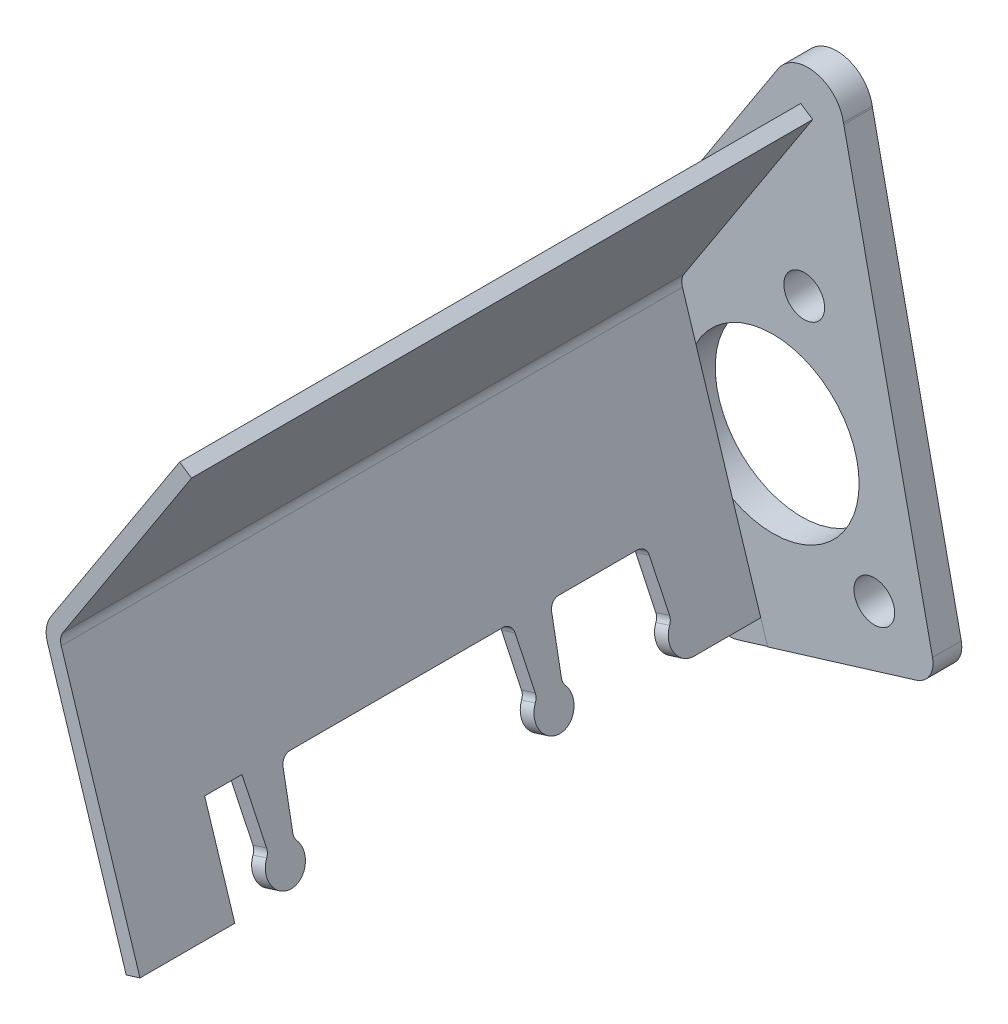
ISO-10303-21;
HEADER;
FILE_DESCRIPTION(('STEP AP214'),'2;1');
FILE_NAME('part.step','',(''),(''),'','','');
FILE_SCHEMA(('AUTOMOTIVE_DESIGN { 1 0 10303 214 1 1 1 1 }'));
ENDSEC;
DATA;
#1=APPLICATION_CONTEXT('core data for automotive mechanical design processes');
#2=APPLICATION_PROTOCOL_DEFINITION('international standard','automotive_design',2000,#1);
#3=PRODUCT_CONTEXT('',#1,'mechanical');
#4=PRODUCT('Part','Part','',(#3));
#5=PRODUCT_RELATED_PRODUCT_CATEGORY('part','',(#4));
#6=PRODUCT_DEFINITION_FORMATION('','',#4);
#7=PRODUCT_DEFINITION_CONTEXT('part definition',#1,'design');
#8=PRODUCT_DEFINITION('design','',#6,#7);
#9=PRODUCT_DEFINITION_SHAPE('','',#8);
#10=(LENGTH_UNIT() NAMED_UNIT(*) SI_UNIT(.MILLI.,.METRE.));
#11=(NAMED_UNIT(*) PLANE_ANGLE_UNIT() SI_UNIT($,.RADIAN.));
#12=(NAMED_UNIT(*) SI_UNIT($,.STERADIAN.) SOLID_ANGLE_UNIT());
#13=UNCERTAINTY_MEASURE_WITH_UNIT(LENGTH_MEASURE(1.E-05),#10,'distance_accuracy_value','');
#14=(GEOMETRIC_REPRESENTATION_CONTEXT(3) GLOBAL_UNCERTAINTY_ASSIGNED_CONTEXT((#13)) GLOBAL_UNIT_ASSIGNED_CONTEXT((#10,
#11,#12)) REPRESENTATION_CONTEXT('',''));
#15=CARTESIAN_POINT('',(0.,0.,0.));
#16=DIRECTION('',(0.,0.,1.));
#17=DIRECTION('',(1.,0.,0.));
#18=AXIS2_PLACEMENT_3D('',#15,#16,#17);
#19=CARTESIAN_POINT('',(-23.6884849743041,-6.98196917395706,5.99999999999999));
#20=DIRECTION('',(0.,0.,1.));
#21=DIRECTION('',(0.999999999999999,0.,0.));
#22=AXIS2_PLACEMENT_3D('',#19,#20,#21);
#23=PLANE('',#22);
#24=CARTESIAN_POINT('',(0.697286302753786,0.473509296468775,6.));
#25=DIRECTION('',(0.,0.,1.));
#26=DIRECTION('',(0.999999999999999,0.,0.));
#27=AXIS2_PLACEMENT_3D('',#24,#25,#26);
#28=CIRCLE('',#27,18.);
#29=CARTESIAN_POINT('',(-16.9730573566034,3.90264256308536,6.));
#30=VERTEX_POINT('',#29);
#31=CARTESIAN_POINT('',(-11.7696295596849,-12.5101731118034,6.));
#32=VERTEX_POINT('',#31);
#33=EDGE_CURVE('E45',#30,#32,#28,.T.);
#34=ORIENTED_EDGE('',*,*,#33,.F.);
#35=DIRECTION('',(0.302210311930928,-0.953241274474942,0.));
#36=VECTOR('',#35,1.);
#37=CARTESIAN_POINT('',(-21.0430528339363,16.7403503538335,6.));
#38=LINE('',#37,#36);
#39=CARTESIAN_POINT('',(-21.0430528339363,16.7403503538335,6.));
#40=VERTEX_POINT('',#39);
#41=EDGE_CURVE('E337',#40,#30,#38,.T.);
#42=ORIENTED_EDGE('',*,*,#41,.F.);
#43=CARTESIAN_POINT('',(-15.2857081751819,18.4294277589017,6.));
#44=DIRECTION('',(0.,0.,1.));
#45=DIRECTION('',(0.999999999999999,0.,0.));
#46=AXIS2_PLACEMENT_3D('',#43,#44,#45);
#47=CIRCLE('',#46,6.);
#48=CARTESIAN_POINT('',(-20.2717615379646,21.7669825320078,6.));
#49=VERTEX_POINT('',#48);
#50=EDGE_CURVE('E350',#49,#40,#47,.T.);
#51=ORIENTED_EDGE('',*,*,#50,.F.);
#52=DIRECTION('',(-0.544639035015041,-0.838670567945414,0.));
#53=VECTOR('',#52,1.);
#54=CARTESIAN_POINT('',(6.52074986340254,63.0238321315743,6.));
#55=LINE('',#54,#53);
#56=CARTESIAN_POINT('',(6.52074986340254,63.0238321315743,6.));
#57=VERTEX_POINT('',#56);
#58=EDGE_CURVE('E704',#57,#49,#55,.T.);
#59=ORIENTED_EDGE('',*,*,#58,.F.);
#60=DIRECTION('',(-0.838670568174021,0.544639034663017,0.));
#61=VECTOR('',#60,1.);
#62=CARTESIAN_POINT('',(6.52074986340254,63.0238321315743,6.));
#63=LINE('',#62,#61);
#64=CARTESIAN_POINT('',(9.03676156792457,61.3899150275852,6.));
#65=VERTEX_POINT('',#64);
#66=EDGE_CURVE('E703',#65,#57,#63,.T.);
#67=ORIENTED_EDGE('',*,*,#66,.F.);
#68=DIRECTION('',(0.544639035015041,0.838670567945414,0.));
#69=VECTOR('',#68,1.);
#70=CARTESIAN_POINT('',(9.03676156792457,61.3899150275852,6.));
#71=LINE('',#70,#69);
#72=CARTESIAN_POINT('',(-17.8005022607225,20.0641527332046,6.));
#73=VERTEX_POINT('',#72);
#74=EDGE_CURVE('E701',#73,#65,#71,.T.);
#75=ORIENTED_EDGE('',*,*,#74,.F.);
#76=CARTESIAN_POINT('',(-15.2844905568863,18.4302356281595,6.));
#77=DIRECTION('',(0.,0.,-1.));
#78=DIRECTION('',(0.999999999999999,0.,0.));
#79=AXIS2_PLACEMENT_3D('',#76,#77,#78);
#80=CIRCLE('',#79,3.);
#81=CARTESIAN_POINT('',(-18.1442143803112,17.5236046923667,6.));
#82=VERTEX_POINT('',#81);
#83=EDGE_CURVE('E698',#82,#73,#80,.T.);
#84=ORIENTED_EDGE('',*,*,#83,.F.);
#85=DIRECTION('',(-0.302210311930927,0.953241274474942,0.));
#86=VECTOR('',#85,1.);
#87=CARTESIAN_POINT('',(-18.1442143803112,17.5236046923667,6.));
#88=LINE('',#87,#86);
#89=CARTESIAN_POINT('',(-15.3338422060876,8.6590403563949,6.));
#90=VERTEX_POINT('',#89);
#91=EDGE_CURVE('E345',#90,#82,#88,.T.);
#92=ORIENTED_EDGE('',*,*,#91,.F.);
#93=CARTESIAN_POINT('',(-7.68939706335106,-15.4533090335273,6.));
#94=VERTEX_POINT('',#93);
#95=EDGE_CURVE('E330',#94,#90,#28,.T.);
#96=ORIENTED_EDGE('',*,*,#95,.F.);
#97=CARTESIAN_POINT('',(-1.81062048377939,-33.9963310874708,6.));
#98=VERTEX_POINT('',#97);
#99=EDGE_CURVE('E355',#98,#94,#88,.T.);
#100=ORIENTED_EDGE('',*,*,#99,.F.);
#101=CARTESIAN_POINT('',(-0.369131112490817,-38.5431222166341,6.));
#102=VERTEX_POINT('',#101);
#103=EDGE_CURVE('E349',#102,#98,#88,.T.);
#104=ORIENTED_EDGE('',*,*,#103,.F.);
#105=DIRECTION('',(0.956304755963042,0.29237170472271,0.));
#106=VECTOR('',#105,1.);
#107=CARTESIAN_POINT('',(-6.82099631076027,-40.5156553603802,5.99999999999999));
#108=LINE('',#107,#106);
#109=CARTESIAN_POINT('',(30.563046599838,-29.0862064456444,6.));
#110=VERTEX_POINT('',#109);
#111=EDGE_CURVE('E442',#102,#110,#108,.T.);
#112=ORIENTED_EDGE('',*,*,#111,.T.);
#113=CARTESIAN_POINT('',(29.1075642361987,-24.3027379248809,6.));
#114=DIRECTION('',(0.,0.,1.));
#115=DIRECTION('',(0.999999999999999,0.,0.));
#116=AXIS2_PLACEMENT_3D('',#113,#114,#115);
#117=CIRCLE('',#116,5.);
#118=CARTESIAN_POINT('',(33.9990645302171,-23.2667722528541,6.));
#119=VERTEX_POINT('',#118);
#120=EDGE_CURVE('E444',#110,#119,#117,.T.);
#121=ORIENTED_EDGE('',*,*,#120,.T.);
#122=DIRECTION('',(-0.207911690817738,0.97814760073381,0.));
#123=VECTOR('',#122,1.);
#124=CARTESIAN_POINT('',(33.9990645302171,-23.2667722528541,6.));
#125=LINE('',#124,#123);
#126=CARTESIAN_POINT('',(15.506551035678,63.7336635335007,6.00000000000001));
#127=VERTEX_POINT('',#126);
#128=EDGE_CURVE('E446',#119,#127,#125,.T.);
#129=ORIENTED_EDGE('',*,*,#128,.T.);
#130=CARTESIAN_POINT('',(9.63766543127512,62.4861933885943,6.00000000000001));
#131=DIRECTION('',(0.,0.,1.));
#132=DIRECTION('',(0.999999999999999,0.,0.));
#133=AXIS2_PLACEMENT_3D('',#130,#131,#132);
#134=CIRCLE('',#133,6.00000000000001);
#135=CARTESIAN_POINT('',(15.4385444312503,64.0191000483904,6.00000000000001));
#136=VERTEX_POINT('',#135);
#137=EDGE_CURVE('E448',#127,#136,#134,.T.);
#138=ORIENTED_EDGE('',*,*,#137,.T.);
#139=CARTESIAN_POINT('',(8.04126426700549,62.7820688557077,6.));
#140=DIRECTION('',(0.,0.,1.));
#141=DIRECTION('',(0.999999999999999,0.,0.));
#142=AXIS2_PLACEMENT_3D('',#139,#140,#141);
#143=CIRCLE('',#142,7.5);
#144=CARTESIAN_POINT('',(1.75123500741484,66.8668616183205,6.00000000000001));
#145=VERTEX_POINT('',#144);
#146=EDGE_CURVE('E450',#136,#145,#143,.T.);
#147=ORIENTED_EDGE('',*,*,#146,.T.);
#148=DIRECTION('',(-0.544639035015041,-0.838670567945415,0.));
#149=VECTOR('',#148,1.);
#150=CARTESIAN_POINT('',(1.75123500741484,66.8668616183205,6.00000000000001));
#151=LINE('',#150,#149);
#152=CARTESIAN_POINT('',(-26.2311410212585,23.7777811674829,5.99999999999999));
#153=VERTEX_POINT('',#152);
#154=EDGE_CURVE('E452',#145,#153,#151,.T.);
#155=ORIENTED_EDGE('',*,*,#154,.T.);
#156=CARTESIAN_POINT('',(-17.8444353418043,18.3313908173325,6.));
#157=DIRECTION('',(0.,0.,1.));
#158=DIRECTION('',(0.999999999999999,0.,0.));
#159=AXIS2_PLACEMENT_3D('',#156,#157,#158);
#160=CIRCLE('',#159,10.);
#161=CARTESIAN_POINT('',(-27.5881359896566,20.5809013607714,5.99999999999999));
#162=VERTEX_POINT('',#161);
#163=EDGE_CURVE('E454',#153,#162,#160,.T.);
#164=ORIENTED_EDGE('',*,*,#163,.T.);
#165=DIRECTION('',(-0.224951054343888,-0.97437006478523,0.));
#166=VECTOR('',#165,1.);
#167=CARTESIAN_POINT('',(-33.4321856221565,-4.73245863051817,5.99999999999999));
#168=LINE('',#167,#166);
#169=CARTESIAN_POINT('',(-33.4321856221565,-4.73245863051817,5.99999999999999));
#170=VERTEX_POINT('',#169);
#171=EDGE_CURVE('E456',#162,#170,#168,.T.);
#172=ORIENTED_EDGE('',*,*,#171,.T.);
#173=CARTESIAN_POINT('',(-23.6884849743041,-6.98196917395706,5.99999999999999));
#174=DIRECTION('',(0.,0.,1.));
#175=DIRECTION('',(0.999999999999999,0.,0.));
#176=AXIS2_PLACEMENT_3D('',#173,#174,#175);
#177=CIRCLE('',#176,10.);
#178=CARTESIAN_POINT('',(-31.6748400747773,-13.0001194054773,6.));
#179=VERTEX_POINT('',#178);
#180=EDGE_CURVE('E436',#170,#179,#177,.T.);
#181=ORIENTED_EDGE('',*,*,#180,.T.);
#182=DIRECTION('',(0.601815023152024,-0.798635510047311,0.));
#183=VECTOR('',#182,1.);
#184=CARTESIAN_POINT('',(-31.6748400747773,-13.0001194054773,6.));
#185=LINE('',#184,#183);
#186=CARTESIAN_POINT('',(-13.1451994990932,-37.5897829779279,5.99999999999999));
#187=VERTEX_POINT('',#186);
#188=EDGE_CURVE('E439',#179,#187,#185,.T.);
#189=ORIENTED_EDGE('',*,*,#188,.T.);
#190=DIRECTION('',(-0.953241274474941,-0.302210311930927,0.));
#191=VECTOR('',#190,1.);
#192=CARTESIAN_POINT('',(-13.9080765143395,-37.8316412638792,5.99999999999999));
#193=LINE('',#192,#191);
#194=CARTESIAN_POINT('',(-4.67034430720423,-34.9029620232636,6.00000000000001));
#195=VERTEX_POINT('',#194);
#196=EDGE_CURVE('E666',#195,#187,#193,.T.);
#197=ORIENTED_EDGE('',*,*,#196,.F.);
#198=EDGE_CURVE('E339',#32,#195,#38,.T.);
#199=ORIENTED_EDGE('',*,*,#198,.F.);
#200=EDGE_LOOP('',(#34,#42,#51,#59,#67,#75,#84,#92,#96,#100,#104,#112,#121,#129,#138,#147,#155,
#164,#172,#181,#189,#197,#199));
#201=FACE_BOUND('',#200,.T.);
#202=CARTESIAN_POINT('',(21.8729978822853,-19.1947198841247,6.));
#203=DIRECTION('',(0.,0.,1.));
#204=DIRECTION('',(0.999999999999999,0.,0.));
#205=AXIS2_PLACEMENT_3D('',#202,#203,#204);
#206=CIRCLE('',#205,4.25000000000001);
#207=CARTESIAN_POINT('',(26.1229978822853,-19.1947198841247,6.));
#208=VERTEX_POINT('',#207);
#209=EDGE_CURVE('E396',#208,#208,#206,.T.);
#210=ORIENTED_EDGE('',*,*,#209,.F.);
#211=EDGE_LOOP('',(#210));
#212=FACE_BOUND('',#211,.T.);
#213=CARTESIAN_POINT('',(-23.6884849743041,-6.98196917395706,5.99999999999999));
#214=DIRECTION('',(0.,0.,1.));
#215=DIRECTION('',(0.999999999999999,0.,0.));
#216=AXIS2_PLACEMENT_3D('',#213,#214,#215);
#217=CIRCLE('',#216,4.25000000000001);
#218=CARTESIAN_POINT('',(-19.4384849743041,-6.98196917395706,6.));
#219=VERTEX_POINT('',#218);
#220=EDGE_CURVE('E408',#219,#219,#217,.T.);
#221=ORIENTED_EDGE('',*,*,#220,.F.);
#222=EDGE_LOOP('',(#221));
#223=FACE_BOUND('',#222,.T.);
#224=CARTESIAN_POINT('',(7.25441264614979,28.6205179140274,6.));
#225=DIRECTION('',(0.,0.,1.));
#226=DIRECTION('',(0.999999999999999,0.,0.));
#227=AXIS2_PLACEMENT_3D('',#224,#225,#226);
#228=CIRCLE('',#227,4.24999999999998);
#229=CARTESIAN_POINT('',(11.5044126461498,28.6205179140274,6.));
#230=VERTEX_POINT('',#229);
#231=EDGE_CURVE('E402',#230,#230,#228,.T.);
#232=ORIENTED_EDGE('',*,*,#231,.F.);
#233=EDGE_LOOP('',(#232));
#234=FACE_BOUND('',#233,.T.);
#235=ADVANCED_FACE('F30',(#201,#212,#223,#234),#23,.T.);
#236=CARTESIAN_POINT('',(-23.6884849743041,-6.98196917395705,0.));
#237=DIRECTION('',(0.,0.,1.));
#238=DIRECTION('',(0.999999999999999,0.,0.));
#239=AXIS2_PLACEMENT_3D('',#236,#237,#238);
#240=PLANE('',#239);
#241=CARTESIAN_POINT('',(0.697286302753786,0.473509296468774,0.));
#242=DIRECTION('',(0.,0.,1.));
#243=DIRECTION('',(0.999999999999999,0.,0.));
#244=AXIS2_PLACEMENT_3D('',#241,#242,#243);
#245=CIRCLE('',#244,18.);
#246=CARTESIAN_POINT('',(18.6972863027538,0.473509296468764,0.));
#247=VERTEX_POINT('',#246);
#248=EDGE_CURVE('E326',#247,#247,#245,.T.);
#249=ORIENTED_EDGE('',*,*,#248,.T.);
#250=EDGE_LOOP('',(#249));
#251=FACE_BOUND('',#250,.T.);
#252=CARTESIAN_POINT('',(7.25441264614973,28.6205179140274,0.));
#253=DIRECTION('',(0.,0.,1.));
#254=DIRECTION('',(0.999999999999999,0.,0.));
#255=AXIS2_PLACEMENT_3D('',#252,#253,#254);
#256=CIRCLE('',#255,4.24999999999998);
#257=CARTESIAN_POINT('',(11.5044126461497,28.6205179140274,0.));
#258=VERTEX_POINT('',#257);
#259=EDGE_CURVE('E399',#258,#258,#256,.T.);
#260=ORIENTED_EDGE('',*,*,#259,.T.);
#261=EDGE_LOOP('',(#260));
#262=FACE_BOUND('',#261,.T.);
#263=CARTESIAN_POINT('',(-23.6884849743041,-6.98196917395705,0.));
#264=DIRECTION('',(0.,0.,1.));
#265=DIRECTION('',(0.999999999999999,0.,0.));
#266=AXIS2_PLACEMENT_3D('',#263,#264,#265);
#267=CIRCLE('',#266,10.);
#268=CARTESIAN_POINT('',(-33.4321856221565,-4.73245863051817,0.));
#269=VERTEX_POINT('',#268);
#270=CARTESIAN_POINT('',(-31.6748400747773,-13.0001194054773,0.));
#271=VERTEX_POINT('',#270);
#272=EDGE_CURVE('E411',#269,#271,#267,.T.);
#273=ORIENTED_EDGE('',*,*,#272,.F.);
#274=DIRECTION('',(-0.224951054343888,-0.97437006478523,0.));
#275=VECTOR('',#274,1.);
#276=CARTESIAN_POINT('',(-33.4321856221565,-4.73245863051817,0.));
#277=LINE('',#276,#275);
#278=CARTESIAN_POINT('',(-27.5881359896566,20.5809013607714,0.));
#279=VERTEX_POINT('',#278);
#280=EDGE_CURVE('E434',#279,#269,#277,.T.);
#281=ORIENTED_EDGE('',*,*,#280,.F.);
#282=CARTESIAN_POINT('',(-17.8444353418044,18.3313908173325,0.));
#283=DIRECTION('',(0.,0.,1.));
#284=DIRECTION('',(0.999999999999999,0.,0.));
#285=AXIS2_PLACEMENT_3D('',#282,#283,#284);
#286=CIRCLE('',#285,10.);
#287=CARTESIAN_POINT('',(-26.2311410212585,23.7777811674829,0.));
#288=VERTEX_POINT('',#287);
#289=EDGE_CURVE('E432',#288,#279,#286,.T.);
#290=ORIENTED_EDGE('',*,*,#289,.F.);
#291=DIRECTION('',(-0.544639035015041,-0.838670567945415,0.));
#292=VECTOR('',#291,1.);
#293=CARTESIAN_POINT('',(1.75123500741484,66.8668616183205,0.));
#294=LINE('',#293,#292);
#295=CARTESIAN_POINT('',(1.75123500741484,66.8668616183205,0.));
#296=VERTEX_POINT('',#295);
#297=EDGE_CURVE('E430',#296,#288,#294,.T.);
#298=ORIENTED_EDGE('',*,*,#297,.F.);
#299=CARTESIAN_POINT('',(8.04126426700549,62.7820688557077,0.));
#300=DIRECTION('',(0.,0.,1.));
#301=DIRECTION('',(0.999999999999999,0.,0.));
#302=AXIS2_PLACEMENT_3D('',#299,#300,#301);
#303=CIRCLE('',#302,7.5);
#304=CARTESIAN_POINT('',(15.4385444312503,64.0191000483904,0.));
#305=VERTEX_POINT('',#304);
#306=EDGE_CURVE('E428',#305,#296,#303,.T.);
#307=ORIENTED_EDGE('',*,*,#306,.F.);
#308=CARTESIAN_POINT('',(9.63766543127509,62.4861933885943,0.));
#309=DIRECTION('',(0.,0.,1.));
#310=DIRECTION('',(0.999999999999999,0.,0.));
#311=AXIS2_PLACEMENT_3D('',#308,#309,#310);
#312=CIRCLE('',#311,6.00000000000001);
#313=CARTESIAN_POINT('',(15.506551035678,63.7336635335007,0.));
#314=VERTEX_POINT('',#313);
#315=EDGE_CURVE('E426',#314,#305,#312,.T.);
#316=ORIENTED_EDGE('',*,*,#315,.F.);
#317=DIRECTION('',(-0.207911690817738,0.97814760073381,0.));
#318=VECTOR('',#317,1.);
#319=CARTESIAN_POINT('',(33.9990645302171,-23.2667722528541,0.));
#320=LINE('',#319,#318);
#321=CARTESIAN_POINT('',(33.9990645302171,-23.2667722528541,0.));
#322=VERTEX_POINT('',#321);
#323=EDGE_CURVE('E424',#322,#314,#320,.T.);
#324=ORIENTED_EDGE('',*,*,#323,.F.);
#325=CARTESIAN_POINT('',(29.1075642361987,-24.3027379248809,0.));
#326=DIRECTION('',(0.,0.,1.));
#327=DIRECTION('',(0.999999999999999,0.,0.));
#328=AXIS2_PLACEMENT_3D('',#325,#326,#327);
#329=CIRCLE('',#328,5.);
#330=CARTESIAN_POINT('',(30.563046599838,-29.0862064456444,0.));
#331=VERTEX_POINT('',#330);
#332=EDGE_CURVE('E422',#331,#322,#329,.T.);
#333=ORIENTED_EDGE('',*,*,#332,.F.);
#334=DIRECTION('',(0.956304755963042,0.29237170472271,0.));
#335=VECTOR('',#334,1.);
#336=CARTESIAN_POINT('',(-6.8209963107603,-40.5156553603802,0.));
#337=LINE('',#336,#335);
#338=CARTESIAN_POINT('',(-6.8209963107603,-40.5156553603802,0.));
#339=VERTEX_POINT('',#338);
#340=EDGE_CURVE('E420',#339,#331,#337,.T.);
#341=ORIENTED_EDGE('',*,*,#340,.F.);
#342=CARTESIAN_POINT('',(-8.28285483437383,-35.734131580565,0.));
#343=DIRECTION('',(0.,0.,1.));
#344=DIRECTION('',(0.999999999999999,0.,0.));
#345=AXIS2_PLACEMENT_3D('',#342,#343,#344);
#346=CIRCLE('',#345,5.);
#347=CARTESIAN_POINT('',(-12.2760323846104,-38.7432066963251,0.));
#348=VERTEX_POINT('',#347);
#349=EDGE_CURVE('E417',#348,#339,#346,.T.);
#350=ORIENTED_EDGE('',*,*,#349,.F.);
#351=DIRECTION('',(0.601815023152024,-0.798635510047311,0.));
#352=VECTOR('',#351,1.);
#353=CARTESIAN_POINT('',(-31.6748400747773,-13.0001194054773,0.));
#354=LINE('',#353,#352);
#355=EDGE_CURVE('E414',#271,#348,#354,.T.);
#356=ORIENTED_EDGE('',*,*,#355,.F.);
#357=EDGE_LOOP('',(#273,#281,#290,#298,#307,#316,#324,#333,#341,#350,#356));
#358=FACE_BOUND('',#357,.T.);
#359=CARTESIAN_POINT('',(-23.6884849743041,-6.98196917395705,0.));
#360=DIRECTION('',(0.,0.,1.));
#361=DIRECTION('',(0.999999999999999,0.,0.));
#362=AXIS2_PLACEMENT_3D('',#359,#360,#361);
#363=CIRCLE('',#362,4.25000000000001);
#364=CARTESIAN_POINT('',(-19.4384849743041,-6.98196917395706,0.));
#365=VERTEX_POINT('',#364);
#366=EDGE_CURVE('E405',#365,#365,#363,.T.);
#367=ORIENTED_EDGE('',*,*,#366,.T.);
#368=EDGE_LOOP('',(#367));
#369=FACE_BOUND('',#368,.T.);
#370=CARTESIAN_POINT('',(21.8729978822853,-19.1947198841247,0.));
#371=DIRECTION('',(0.,0.,1.));
#372=DIRECTION('',(0.999999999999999,0.,0.));
#373=AXIS2_PLACEMENT_3D('',#370,#371,#372);
#374=CIRCLE('',#373,4.25000000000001);
#375=CARTESIAN_POINT('',(26.1229978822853,-19.1947198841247,0.));
#376=VERTEX_POINT('',#375);
#377=EDGE_CURVE('E393',#376,#376,#374,.T.);
#378=ORIENTED_EDGE('',*,*,#377,.T.);
#379=EDGE_LOOP('',(#378));
#380=FACE_BOUND('',#379,.T.);
#381=ADVANCED_FACE('F873',(#251,#262,#358,#369,#380),#240,.F.);
#382=CARTESIAN_POINT('',(-23.6884849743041,-6.98196917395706,5.99999999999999));
#383=DIRECTION('',(0.,0.,-1.));
#384=DIRECTION('',(-0.999999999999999,0.,0.));
#385=AXIS2_PLACEMENT_3D('',#382,#383,#384);
#386=CYLINDRICAL_SURFACE('',#385,10.);
#387=ORIENTED_EDGE('',*,*,#272,.T.);
#388=DIRECTION('',(0.,0.,-1.));
#389=VECTOR('',#388,1.);
#390=CARTESIAN_POINT('',(-31.6748400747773,-13.0001194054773,6.));
#391=LINE('',#390,#389);
#392=EDGE_CURVE('E486',#179,#271,#391,.T.);
#393=ORIENTED_EDGE('',*,*,#392,.F.);
#394=ORIENTED_EDGE('',*,*,#180,.F.);
#395=DIRECTION('',(0.,0.,-1.));
#396=VECTOR('',#395,1.);
#397=CARTESIAN_POINT('',(-33.4321856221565,-4.73245863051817,5.99999999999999));
#398=LINE('',#397,#396);
#399=EDGE_CURVE('E458',#170,#269,#398,.T.);
#400=ORIENTED_EDGE('',*,*,#399,.T.);
#401=EDGE_LOOP('',(#387,#393,#394,#400));
#402=FACE_BOUND('',#401,.T.);
#403=ADVANCED_FACE('F32',(#402),#386,.T.);
#404=CARTESIAN_POINT('',(-31.6748400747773,-13.0001194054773,6.));
#405=DIRECTION('',(0.79863551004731,0.601815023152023,0.));
#406=DIRECTION('',(-0.601815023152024,0.798635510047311,0.));
#407=AXIS2_PLACEMENT_3D('',#404,#405,#406);
#408=PLANE('',#407);
#409=DIRECTION('',(-0.601815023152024,0.798635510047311,0.));
#410=VECTOR('',#409,1.);
#411=CARTESIAN_POINT('',(-31.6748400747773,-13.0001194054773,5.89711787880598));
#412=LINE('',#411,#410);
#413=CARTESIAN_POINT('',(-12.2760323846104,-38.7432066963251,5.89711787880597));
#414=VERTEX_POINT('',#413);
#415=CARTESIAN_POINT('',(-13.1451994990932,-37.5897829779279,5.89711787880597));
#416=VERTEX_POINT('',#415);
#417=EDGE_CURVE('E695',#414,#416,#412,.T.);
#418=ORIENTED_EDGE('',*,*,#417,.T.);
#419=DIRECTION('',(0.,0.,1.));
#420=VECTOR('',#419,1.);
#421=CARTESIAN_POINT('',(-13.1451994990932,-37.5897829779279,6.00000000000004));
#422=LINE('',#421,#420);
#423=EDGE_CURVE('E668',#416,#187,#422,.T.);
#424=ORIENTED_EDGE('',*,*,#423,.T.);
#425=ORIENTED_EDGE('',*,*,#188,.F.);
#426=ORIENTED_EDGE('',*,*,#392,.T.);
#427=ORIENTED_EDGE('',*,*,#355,.T.);
#428=DIRECTION('',(0.,0.,-1.));
#429=VECTOR('',#428,1.);
#430=CARTESIAN_POINT('',(-12.2760323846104,-38.7432066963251,5.99999999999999));
#431=LINE('',#430,#429);
#432=EDGE_CURVE('E484',#414,#348,#431,.T.);
#433=ORIENTED_EDGE('',*,*,#432,.F.);
#434=EDGE_LOOP('',(#418,#424,#425,#426,#427,#433));
#435=FACE_BOUND('',#434,.T.);
#436=ADVANCED_FACE('F821',(#435),#408,.F.);
#437=CARTESIAN_POINT('',(-8.28285483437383,-35.734131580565,6.));
#438=DIRECTION('',(0.,0.,-1.));
#439=DIRECTION('',(-0.999999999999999,0.,0.));
#440=AXIS2_PLACEMENT_3D('',#437,#438,#439);
#441=CYLINDRICAL_SURFACE('',#440,5.);
#442=DIRECTION('',(0.,0.,-1.));
#443=VECTOR('',#442,1.);
#444=CARTESIAN_POINT('',(-6.82099631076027,-40.5156553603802,5.99999999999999));
#445=LINE('',#444,#443);
#446=CARTESIAN_POINT('',(-6.82099631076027,-40.5156553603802,5.89711787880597));
#447=VERTEX_POINT('',#446);
#448=EDGE_CURVE('E482',#447,#339,#445,.T.);
#449=ORIENTED_EDGE('',*,*,#448,.F.);
#450=CARTESIAN_POINT('',(-8.28285483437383,-35.734131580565,5.89711787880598));
#451=DIRECTION('',(0.,0.,-1.));
#452=DIRECTION('',(-0.999999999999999,0.,0.));
#453=AXIS2_PLACEMENT_3D('',#450,#451,#452);
#454=CIRCLE('',#453,5.);
#455=EDGE_CURVE('E692',#447,#414,#454,.T.);
#456=ORIENTED_EDGE('',*,*,#455,.T.);
#457=ORIENTED_EDGE('',*,*,#432,.T.);
#458=ORIENTED_EDGE('',*,*,#349,.T.);
#459=EDGE_LOOP('',(#449,#456,#457,#458));
#460=FACE_BOUND('',#459,.T.);
#461=ADVANCED_FACE('F878',(#460),#441,.T.);
#462=CARTESIAN_POINT('',(-6.82099631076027,-40.5156553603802,5.99999999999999));
#463=DIRECTION('',(-0.292371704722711,0.956304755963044,0.));
#464=DIRECTION('',(-0.956304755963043,-0.29237170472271,0.));
#465=AXIS2_PLACEMENT_3D('',#462,#463,#464);
#466=PLANE('',#465);
#467=DIRECTION('',(0.,0.,-1.));
#468=VECTOR('',#467,1.);
#469=CARTESIAN_POINT('',(-0.369131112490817,-38.5431222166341,6.));
#470=LINE('',#469,#468);
#471=CARTESIAN_POINT('',(-0.369131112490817,-38.5431222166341,5.89711787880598));
#472=VERTEX_POINT('',#471);
#473=EDGE_CURVE('E689',#102,#472,#470,.T.);
#474=ORIENTED_EDGE('',*,*,#473,.T.);
#475=DIRECTION('',(-0.956304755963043,-0.29237170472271,0.));
#476=VECTOR('',#475,1.);
#477=CARTESIAN_POINT('',(-6.82099631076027,-40.5156553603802,5.89711787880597));
#478=LINE('',#477,#476);
#479=EDGE_CURVE('E11',#472,#447,#478,.T.);
#480=ORIENTED_EDGE('',*,*,#479,.T.);
#481=ORIENTED_EDGE('',*,*,#448,.T.);
#482=ORIENTED_EDGE('',*,*,#340,.T.);
#483=DIRECTION('',(0.,0.,-1.));
#484=VECTOR('',#483,1.);
#485=CARTESIAN_POINT('',(30.563046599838,-29.0862064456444,6.));
#486=LINE('',#485,#484);
#487=EDGE_CURVE('E479',#110,#331,#486,.T.);
#488=ORIENTED_EDGE('',*,*,#487,.F.);
#489=ORIENTED_EDGE('',*,*,#111,.F.);
#490=EDGE_LOOP('',(#474,#480,#481,#482,#488,#489));
#491=FACE_BOUND('',#490,.T.);
#492=ADVANCED_FACE('F832',(#491),#466,.F.);
#493=CARTESIAN_POINT('',(29.1075642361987,-24.3027379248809,6.));
#494=DIRECTION('',(0.,0.,-1.));
#495=DIRECTION('',(-0.999999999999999,0.,0.));
#496=AXIS2_PLACEMENT_3D('',#493,#494,#495);
#497=CYLINDRICAL_SURFACE('',#496,5.);
#498=ORIENTED_EDGE('',*,*,#332,.T.);
#499=DIRECTION('',(0.,0.,-1.));
#500=VECTOR('',#499,1.);
#501=CARTESIAN_POINT('',(33.9990645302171,-23.2667722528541,6.));
#502=LINE('',#501,#500);
#503=EDGE_CURVE('E476',#119,#322,#502,.T.);
#504=ORIENTED_EDGE('',*,*,#503,.F.);
#505=ORIENTED_EDGE('',*,*,#120,.F.);
#506=ORIENTED_EDGE('',*,*,#487,.T.);
#507=EDGE_LOOP('',(#498,#504,#505,#506));
#508=FACE_BOUND('',#507,.T.);
#509=ADVANCED_FACE('F840',(#508),#497,.T.);
#510=CARTESIAN_POINT('',(33.9990645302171,-23.2667722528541,6.));
#511=DIRECTION('',(-0.978147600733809,-0.207911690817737,0.));
#512=DIRECTION('',(0.207911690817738,-0.97814760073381,0.));
#513=AXIS2_PLACEMENT_3D('',#510,#511,#512);
#514=PLANE('',#513);
#515=ORIENTED_EDGE('',*,*,#323,.T.);
#516=DIRECTION('',(0.,0.,-1.));
#517=VECTOR('',#516,1.);
#518=CARTESIAN_POINT('',(15.506551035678,63.7336635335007,6.00000000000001));
#519=LINE('',#518,#517);
#520=EDGE_CURVE('E473',#127,#314,#519,.T.);
#521=ORIENTED_EDGE('',*,*,#520,.F.);
#522=ORIENTED_EDGE('',*,*,#128,.F.);
#523=ORIENTED_EDGE('',*,*,#503,.T.);
#524=EDGE_LOOP('',(#515,#521,#522,#523));
#525=FACE_BOUND('',#524,.T.);
#526=ADVANCED_FACE('F844',(#525),#514,.F.);
#527=CARTESIAN_POINT('',(9.63766543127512,62.4861933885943,6.00000000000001));
#528=DIRECTION('',(0.,0.,-1.));
#529=DIRECTION('',(-0.999999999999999,0.,0.));
#530=AXIS2_PLACEMENT_3D('',#527,#528,#529);
#531=CYLINDRICAL_SURFACE('',#530,6.00000000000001);
#532=ORIENTED_EDGE('',*,*,#315,.T.);
#533=DIRECTION('',(0.,0.,-1.));
#534=VECTOR('',#533,1.);
#535=CARTESIAN_POINT('',(15.4385444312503,64.0191000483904,6.00000000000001));
#536=LINE('',#535,#534);
#537=EDGE_CURVE('E470',#136,#305,#536,.T.);
#538=ORIENTED_EDGE('',*,*,#537,.F.);
#539=ORIENTED_EDGE('',*,*,#137,.F.);
#540=ORIENTED_EDGE('',*,*,#520,.T.);
#541=EDGE_LOOP('',(#532,#538,#539,#540));
#542=FACE_BOUND('',#541,.T.);
#543=ADVANCED_FACE('F849',(#542),#531,.T.);
#544=CARTESIAN_POINT('',(8.04126426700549,62.7820688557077,6.));
#545=DIRECTION('',(0.,0.,-1.));
#546=DIRECTION('',(-0.999999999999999,0.,0.));
#547=AXIS2_PLACEMENT_3D('',#544,#545,#546);
#548=CYLINDRICAL_SURFACE('',#547,7.5);
#549=ORIENTED_EDGE('',*,*,#306,.T.);
#550=DIRECTION('',(0.,0.,-1.));
#551=VECTOR('',#550,1.);
#552=CARTESIAN_POINT('',(1.75123500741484,66.8668616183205,6.00000000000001));
#553=LINE('',#552,#551);
#554=EDGE_CURVE('E467',#145,#296,#553,.T.);
#555=ORIENTED_EDGE('',*,*,#554,.F.);
#556=ORIENTED_EDGE('',*,*,#146,.F.);
#557=ORIENTED_EDGE('',*,*,#537,.T.);
#558=EDGE_LOOP('',(#549,#555,#556,#557));
#559=FACE_BOUND('',#558,.T.);
#560=ADVANCED_FACE('F855',(#559),#548,.T.);
#561=CARTESIAN_POINT('',(1.75123500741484,66.8668616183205,6.00000000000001));
#562=DIRECTION('',(0.838670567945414,-0.544639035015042,0.));
#563=DIRECTION('',(0.544639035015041,0.838670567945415,0.));
#564=AXIS2_PLACEMENT_3D('',#561,#562,#563);
#565=PLANE('',#564);
#566=ORIENTED_EDGE('',*,*,#297,.T.);
#567=DIRECTION('',(0.,0.,-1.));
#568=VECTOR('',#567,1.);
#569=CARTESIAN_POINT('',(-26.2311410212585,23.7777811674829,5.99999999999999));
#570=LINE('',#569,#568);
#571=EDGE_CURVE('E464',#153,#288,#570,.T.);
#572=ORIENTED_EDGE('',*,*,#571,.F.);
#573=ORIENTED_EDGE('',*,*,#154,.F.);
#574=ORIENTED_EDGE('',*,*,#554,.T.);
#575=EDGE_LOOP('',(#566,#572,#573,#574));
#576=FACE_BOUND('',#575,.T.);
#577=ADVANCED_FACE('F859',(#576),#565,.F.);
#578=CARTESIAN_POINT('',(-17.8444353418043,18.3313908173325,6.));
#579=DIRECTION('',(0.,0.,-1.));
#580=DIRECTION('',(-0.999999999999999,0.,0.));
#581=AXIS2_PLACEMENT_3D('',#578,#579,#580);
#582=CYLINDRICAL_SURFACE('',#581,10.);
#583=ORIENTED_EDGE('',*,*,#289,.T.);
#584=DIRECTION('',(0.,0.,-1.));
#585=VECTOR('',#584,1.);
#586=CARTESIAN_POINT('',(-27.5881359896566,20.5809013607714,5.99999999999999));
#587=LINE('',#586,#585);
#588=EDGE_CURVE('E461',#162,#279,#587,.T.);
#589=ORIENTED_EDGE('',*,*,#588,.F.);
#590=ORIENTED_EDGE('',*,*,#163,.F.);
#591=ORIENTED_EDGE('',*,*,#571,.T.);
#592=EDGE_LOOP('',(#583,#589,#590,#591));
#593=FACE_BOUND('',#592,.T.);
#594=ADVANCED_FACE('F864',(#593),#582,.T.);
#595=CARTESIAN_POINT('',(-33.4321856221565,-4.73245863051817,5.99999999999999));
#596=DIRECTION('',(0.974370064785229,-0.224951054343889,0.));
#597=DIRECTION('',(0.224951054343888,0.97437006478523,0.));
#598=AXIS2_PLACEMENT_3D('',#595,#596,#597);
#599=PLANE('',#598);
#600=ORIENTED_EDGE('',*,*,#280,.T.);
#601=ORIENTED_EDGE('',*,*,#399,.F.);
#602=ORIENTED_EDGE('',*,*,#171,.F.);
#603=ORIENTED_EDGE('',*,*,#588,.T.);
#604=EDGE_LOOP('',(#600,#601,#602,#603));
#605=FACE_BOUND('',#604,.T.);
#606=ADVANCED_FACE('F868',(#605),#599,.F.);
#607=CARTESIAN_POINT('',(-23.6884849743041,-6.98196917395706,5.99999999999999));
#608=DIRECTION('',(0.,0.,-1.));
#609=DIRECTION('',(-0.999999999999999,0.,0.));
#610=AXIS2_PLACEMENT_3D('',#607,#608,#609);
#611=CYLINDRICAL_SURFACE('',#610,4.25000000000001);
#612=ORIENTED_EDGE('',*,*,#220,.T.);
#613=EDGE_LOOP('',(#612));
#614=FACE_BOUND('',#613,.T.);
#615=ORIENTED_EDGE('',*,*,#366,.F.);
#616=EDGE_LOOP('',(#615));
#617=FACE_BOUND('',#616,.T.);
#618=ADVANCED_FACE('F897',(#614,#617),#611,.F.);
#619=CARTESIAN_POINT('',(7.25441264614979,28.6205179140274,6.));
#620=DIRECTION('',(0.,0.,-1.));
#621=DIRECTION('',(-0.999999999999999,0.,0.));
#622=AXIS2_PLACEMENT_3D('',#619,#620,#621);
#623=CYLINDRICAL_SURFACE('',#622,4.24999999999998);
#624=ORIENTED_EDGE('',*,*,#231,.T.);
#625=EDGE_LOOP('',(#624));
#626=FACE_BOUND('',#625,.T.);
#627=ORIENTED_EDGE('',*,*,#259,.F.);
#628=EDGE_LOOP('',(#627));
#629=FACE_BOUND('',#628,.T.);
#630=ADVANCED_FACE('F943',(#626,#629),#623,.F.);
#631=CARTESIAN_POINT('',(21.8729978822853,-19.1947198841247,6.));
#632=DIRECTION('',(0.,0.,-1.));
#633=DIRECTION('',(-0.999999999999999,0.,0.));
#634=AXIS2_PLACEMENT_3D('',#631,#632,#633);
#635=CYLINDRICAL_SURFACE('',#634,4.25000000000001);
#636=ORIENTED_EDGE('',*,*,#209,.T.);
#637=EDGE_LOOP('',(#636));
#638=FACE_BOUND('',#637,.T.);
#639=ORIENTED_EDGE('',*,*,#377,.F.);
#640=EDGE_LOOP('',(#639));
#641=FACE_BOUND('',#640,.T.);
#642=ADVANCED_FACE('F950',(#638,#641),#635,.F.);
#643=CARTESIAN_POINT('',(-15.2844905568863,18.4302356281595,135.5));
#644=DIRECTION('',(0.,0.,-1.));
#645=DIRECTION('',(-0.999999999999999,0.,0.));
#646=AXIS2_PLACEMENT_3D('',#643,#644,#645);
#647=CYLINDRICAL_SURFACE('',#646,3.);
#648=ORIENTED_EDGE('',*,*,#83,.T.);
#649=DIRECTION('',(0.,0.,-1.));
#650=VECTOR('',#649,1.);
#651=CARTESIAN_POINT('',(-17.8005022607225,20.0641527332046,135.5));
#652=LINE('',#651,#650);
#653=CARTESIAN_POINT('',(-17.8005022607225,20.0641527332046,135.5));
#654=VERTEX_POINT('',#653);
#655=EDGE_CURVE('E391',#654,#73,#652,.T.);
#656=ORIENTED_EDGE('',*,*,#655,.F.);
#657=CARTESIAN_POINT('',(-15.2844905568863,18.4302356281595,135.5));
#658=DIRECTION('',(0.,0.,-1.));
#659=DIRECTION('',(0.999999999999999,0.,0.));
#660=AXIS2_PLACEMENT_3D('',#657,#658,#659);
#661=CIRCLE('',#660,3.);
#662=CARTESIAN_POINT('',(-18.1442143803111,17.5236046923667,135.5));
#663=VERTEX_POINT('',#662);
#664=EDGE_CURVE('E354',#663,#654,#661,.T.);
#665=ORIENTED_EDGE('',*,*,#664,.F.);
#666=DIRECTION('',(0.,0.,-1.));
#667=VECTOR('',#666,1.);
#668=CARTESIAN_POINT('',(-18.1442143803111,17.5236046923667,135.5));
#669=LINE('',#668,#667);
#670=EDGE_CURVE('E372',#663,#82,#669,.T.);
#671=ORIENTED_EDGE('',*,*,#670,.T.);
#672=EDGE_LOOP('',(#648,#656,#665,#671));
#673=FACE_BOUND('',#672,.T.);
#674=ADVANCED_FACE('F728',(#673),#647,.F.);
#675=CARTESIAN_POINT('',(9.0367615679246,61.3899150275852,135.5));
#676=DIRECTION('',(-0.838670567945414,0.544639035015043,0.));
#677=DIRECTION('',(-0.544639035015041,-0.838670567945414,0.));
#678=AXIS2_PLACEMENT_3D('',#675,#676,#677);
#679=PLANE('',#678);
#680=ORIENTED_EDGE('',*,*,#74,.T.);
#681=DIRECTION('',(0.,0.,-1.));
#682=VECTOR('',#681,1.);
#683=CARTESIAN_POINT('',(9.0367615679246,61.3899150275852,135.5));
#684=LINE('',#683,#682);
#685=CARTESIAN_POINT('',(9.0367615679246,61.3899150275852,135.5));
#686=VERTEX_POINT('',#685);
#687=EDGE_CURVE('E388',#686,#65,#684,.T.);
#688=ORIENTED_EDGE('',*,*,#687,.F.);
#689=DIRECTION('',(0.544639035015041,0.838670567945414,0.));
#690=VECTOR('',#689,1.);
#691=CARTESIAN_POINT('',(9.0367615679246,61.3899150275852,135.5));
#692=LINE('',#691,#690);
#693=EDGE_CURVE('E358',#654,#686,#692,.T.);
#694=ORIENTED_EDGE('',*,*,#693,.F.);
#695=ORIENTED_EDGE('',*,*,#655,.T.);
#696=EDGE_LOOP('',(#680,#688,#694,#695));
#697=FACE_BOUND('',#696,.T.);
#698=ADVANCED_FACE('F726',(#697),#679,.F.);
#699=CARTESIAN_POINT('',(6.52074986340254,63.0238321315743,135.5));
#700=DIRECTION('',(-0.544639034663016,-0.838670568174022,0.));
#701=DIRECTION('',(0.838670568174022,-0.544639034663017,0.));
#702=AXIS2_PLACEMENT_3D('',#699,#700,#701);
#703=PLANE('',#702);
#704=ORIENTED_EDGE('',*,*,#66,.T.);
#705=DIRECTION('',(0.,0.,-1.));
#706=VECTOR('',#705,1.);
#707=CARTESIAN_POINT('',(6.52074986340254,63.0238321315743,135.5));
#708=LINE('',#707,#706);
#709=CARTESIAN_POINT('',(6.52074986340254,63.0238321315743,135.5));
#710=VERTEX_POINT('',#709);
#711=EDGE_CURVE('E385',#710,#57,#708,.T.);
#712=ORIENTED_EDGE('',*,*,#711,.F.);
#713=DIRECTION('',(-0.838670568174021,0.544639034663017,0.));
#714=VECTOR('',#713,1.);
#715=CARTESIAN_POINT('',(6.52074986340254,63.0238321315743,135.5));
#716=LINE('',#715,#714);
#717=EDGE_CURVE('E360',#686,#710,#716,.T.);
#718=ORIENTED_EDGE('',*,*,#717,.F.);
#719=ORIENTED_EDGE('',*,*,#687,.T.);
#720=EDGE_LOOP('',(#704,#712,#718,#719));
#721=FACE_BOUND('',#720,.T.);
#722=ADVANCED_FACE('F716',(#721),#703,.F.);
#723=CARTESIAN_POINT('',(6.52074986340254,63.0238321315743,135.5));
#724=DIRECTION('',(0.838670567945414,-0.544639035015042,0.));
#725=DIRECTION('',(0.544639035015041,0.838670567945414,0.));
#726=AXIS2_PLACEMENT_3D('',#723,#724,#725);
#727=PLANE('',#726);
#728=ORIENTED_EDGE('',*,*,#58,.T.);
#729=DIRECTION('',(0.,0.,-1.));
#730=VECTOR('',#729,1.);
#731=CARTESIAN_POINT('',(-20.2717615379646,21.7669825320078,135.5));
#732=LINE('',#731,#730);
#733=CARTESIAN_POINT('',(-20.2717615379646,21.7669825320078,135.5));
#734=VERTEX_POINT('',#733);
#735=EDGE_CURVE('E382',#734,#49,#732,.T.);
#736=ORIENTED_EDGE('',*,*,#735,.F.);
#737=DIRECTION('',(-0.544639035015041,-0.838670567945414,0.));
#738=VECTOR('',#737,1.);
#739=CARTESIAN_POINT('',(6.52074986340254,63.0238321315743,135.5));
#740=LINE('',#739,#738);
#741=EDGE_CURVE('E362',#710,#734,#740,.T.);
#742=ORIENTED_EDGE('',*,*,#741,.F.);
#743=ORIENTED_EDGE('',*,*,#711,.T.);
#744=EDGE_LOOP('',(#728,#736,#742,#743));
#745=FACE_BOUND('',#744,.T.);
#746=ADVANCED_FACE('F720',(#745),#727,.F.);
#747=CARTESIAN_POINT('',(-15.2857081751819,18.4294277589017,135.5));
#748=DIRECTION('',(0.,0.,-1.));
#749=DIRECTION('',(-0.999999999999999,0.,0.));
#750=AXIS2_PLACEMENT_3D('',#747,#748,#749);
#751=CYLINDRICAL_SURFACE('',#750,6.);
#752=ORIENTED_EDGE('',*,*,#50,.T.);
#753=DIRECTION('',(0.,0.,-1.));
#754=VECTOR('',#753,1.);
#755=CARTESIAN_POINT('',(-21.0430528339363,16.7403503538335,135.5));
#756=LINE('',#755,#754);
#757=CARTESIAN_POINT('',(-21.0430528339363,16.7403503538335,135.5));
#758=VERTEX_POINT('',#757);
#759=EDGE_CURVE('E344',#758,#40,#756,.T.);
#760=ORIENTED_EDGE('',*,*,#759,.F.);
#761=CARTESIAN_POINT('',(-15.2857081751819,18.4294277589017,135.5));
#762=DIRECTION('',(0.,0.,1.));
#763=DIRECTION('',(0.999999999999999,0.,0.));
#764=AXIS2_PLACEMENT_3D('',#761,#762,#763);
#765=CIRCLE('',#764,6.);
#766=EDGE_CURVE('E364',#734,#758,#765,.T.);
#767=ORIENTED_EDGE('',*,*,#766,.F.);
#768=ORIENTED_EDGE('',*,*,#735,.T.);
#769=EDGE_LOOP('',(#752,#760,#767,#768));
#770=FACE_BOUND('',#769,.T.);
#771=ADVANCED_FACE('F709',(#770),#751,.T.);
#772=CARTESIAN_POINT('',(-21.0430528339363,16.7403503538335,135.5));
#773=DIRECTION('',(0.953241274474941,0.302210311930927,0.));
#774=DIRECTION('',(-0.302210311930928,0.953241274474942,0.));
#775=AXIS2_PLACEMENT_3D('',#772,#773,#774);
#776=PLANE('',#775);
#777=ORIENTED_EDGE('',*,*,#41,.T.);
#778=DIRECTION('',(0.302210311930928,-0.953241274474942,0.));
#779=VECTOR('',#778,1.);
#780=CARTESIAN_POINT('',(-21.0430528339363,16.7403503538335,6.));
#781=LINE('',#780,#779);
#782=EDGE_CURVE('E319',#30,#32,#781,.T.);
#783=ORIENTED_EDGE('',*,*,#782,.T.);
#784=ORIENTED_EDGE('',*,*,#198,.T.);
#785=DIRECTION('',(0.,0.,1.));
#786=VECTOR('',#785,1.);
#787=CARTESIAN_POINT('',(-4.67034430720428,-34.9029620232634,135.5));
#788=LINE('',#787,#786);
#789=CARTESIAN_POINT('',(-4.67034430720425,-34.9029620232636,19.8971178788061));
#790=VERTEX_POINT('',#789);
#791=EDGE_CURVE('E663',#195,#790,#788,.T.);
#792=ORIENTED_EDGE('',*,*,#791,.T.);
#793=CARTESIAN_POINT('',(-5.87918555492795,-31.0899969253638,19.8971178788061));
#794=DIRECTION('',(0.953241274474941,0.302210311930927,0.));
#795=DIRECTION('',(-0.302210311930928,0.953241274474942,0.));
#796=AXIS2_PLACEMENT_3D('',#793,#794,#795);
#797=CIRCLE('',#796,4.00000000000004);
#798=CARTESIAN_POINT('',(-6.62579558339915,-28.7350160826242,23.0430102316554));
#799=VERTEX_POINT('',#798);
#800=EDGE_CURVE('E671',#790,#799,#797,.F.);
#801=ORIENTED_EDGE('',*,*,#800,.T.);
#802=CARTESIAN_POINT('',(-6.99910059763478,-27.5575256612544,24.6159564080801));
#803=DIRECTION('',(0.953241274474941,0.302210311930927,0.));
#804=DIRECTION('',(-0.302210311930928,0.953241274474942,0.));
#805=AXIS2_PLACEMENT_3D('',#802,#803,#804);
#806=CIRCLE('',#805,2.00000000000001);
#807=CARTESIAN_POINT('',(-7.06227975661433,-27.3582439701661,22.6269126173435));
#808=VERTEX_POINT('',#807);
#809=EDGE_CURVE('E674',#799,#808,#806,.T.);
#810=ORIENTED_EDGE('',*,*,#809,.T.);
#811=DIRECTION('',(-0.300554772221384,0.948019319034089,0.104528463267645));
#812=VECTOR('',#811,1.);
#813=CARTESIAN_POINT('',(-24.4363766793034,27.4436791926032,28.6693641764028));
#814=LINE('',#813,#812);
#815=CARTESIAN_POINT('',(-10.1733090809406,-17.5453373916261,23.7088821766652));
#816=VERTEX_POINT('',#815);
#817=EDGE_CURVE('E677',#808,#816,#814,.T.);
#818=ORIENTED_EDGE('',*,*,#817,.T.);
#819=CARTESIAN_POINT('',(-10.110129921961,-17.7446190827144,25.6979259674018));
#820=DIRECTION('',(0.953241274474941,0.302210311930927,0.));
#821=DIRECTION('',(-0.302210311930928,0.953241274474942,0.));
#822=AXIS2_PLACEMENT_3D('',#819,#820,#821);
#823=CIRCLE('',#822,2.00000000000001);
#824=CARTESIAN_POINT('',(-10.7145505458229,-15.8381365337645,25.6979259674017));
#825=VERTEX_POINT('',#824);
#826=EDGE_CURVE('E680',#816,#825,#823,.T.);
#827=ORIENTED_EDGE('',*,*,#826,.T.);
#828=DIRECTION('',(0.,0.,1.));
#829=VECTOR('',#828,1.);
#830=CARTESIAN_POINT('',(-10.7145505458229,-15.8381365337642,135.5));
#831=LINE('',#830,#829);
#832=CARTESIAN_POINT('',(-10.7145505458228,-15.8381365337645,42.0963097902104));
#833=VERTEX_POINT('',#832);
#834=EDGE_CURVE('E683',#825,#833,#831,.T.);
#835=ORIENTED_EDGE('',*,*,#834,.T.);
#836=CARTESIAN_POINT('',(-10.110129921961,-17.7446190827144,42.0963097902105));
#837=DIRECTION('',(0.953241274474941,0.302210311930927,0.));
#838=DIRECTION('',(-0.302210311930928,0.953241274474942,0.));
#839=AXIS2_PLACEMENT_3D('',#836,#837,#838);
#840=CIRCLE('',#839,2.00000000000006);
#841=CARTESIAN_POINT('',(-10.1733090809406,-17.5453373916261,44.0853535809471));
#842=VERTEX_POINT('',#841);
#843=EDGE_CURVE('E686',#833,#842,#840,.T.);
#844=ORIENTED_EDGE('',*,*,#843,.T.);
#845=DIRECTION('',(0.300554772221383,-0.948019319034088,0.104528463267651));
#846=VECTOR('',#845,1.);
#847=CARTESIAN_POINT('',(-18.0523570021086,7.30700346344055,41.3451383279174));
#848=LINE('',#847,#846);
#849=CARTESIAN_POINT('',(-7.06227975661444,-27.358243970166,45.1673231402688));
#850=VERTEX_POINT('',#849);
#851=EDGE_CURVE('E572',#842,#850,#848,.T.);
#852=ORIENTED_EDGE('',*,*,#851,.T.);
#853=CARTESIAN_POINT('',(-6.99910059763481,-27.5575256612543,43.1782793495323));
#854=DIRECTION('',(0.953241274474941,0.302210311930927,0.));
#855=DIRECTION('',(-0.302210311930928,0.953241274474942,0.));
#856=AXIS2_PLACEMENT_3D('',#853,#854,#855);
#857=CIRCLE('',#856,2.00000000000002);
#858=CARTESIAN_POINT('',(-6.62579558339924,-28.7350160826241,44.7512255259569));
#859=VERTEX_POINT('',#858);
#860=EDGE_CURVE('E618',#850,#859,#857,.T.);
#861=ORIENTED_EDGE('',*,*,#860,.T.);
#862=CARTESIAN_POINT('',(-5.87918555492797,-31.0899969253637,47.8971178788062));
#863=DIRECTION('',(0.953241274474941,0.302210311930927,0.));
#864=DIRECTION('',(-0.302210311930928,0.953241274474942,0.));
#865=AXIS2_PLACEMENT_3D('',#862,#863,#864);
#866=CIRCLE('',#865,3.99999999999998);
#867=CARTESIAN_POINT('',(-6.62579558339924,-28.7350160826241,51.0430102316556));
#868=VERTEX_POINT('',#867);
#869=EDGE_CURVE('E621',#859,#868,#866,.F.);
#870=ORIENTED_EDGE('',*,*,#869,.T.);
#871=CARTESIAN_POINT('',(-6.99910059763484,-27.5575256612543,52.6159564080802));
#872=DIRECTION('',(0.953241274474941,0.302210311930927,0.));
#873=DIRECTION('',(-0.302210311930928,0.953241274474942,0.));
#874=AXIS2_PLACEMENT_3D('',#871,#872,#873);
#875=CIRCLE('',#874,2.00000000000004);
#876=CARTESIAN_POINT('',(-7.06227975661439,-27.358243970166,50.6269126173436));
#877=VERTEX_POINT('',#876);
#878=EDGE_CURVE('E624',#868,#877,#875,.T.);
#879=ORIENTED_EDGE('',*,*,#878,.T.);
#880=DIRECTION('',(-0.300554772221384,0.948019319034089,0.104528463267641));
#881=VECTOR('',#880,1.);
#882=CARTESIAN_POINT('',(-23.5567138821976,24.669019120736,56.3634305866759));
#883=LINE('',#882,#881);
#884=CARTESIAN_POINT('',(-10.1733090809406,-17.545337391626,51.7088821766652));
#885=VERTEX_POINT('',#884);
#886=EDGE_CURVE('E627',#877,#885,#883,.T.);
#887=ORIENTED_EDGE('',*,*,#886,.T.);
#888=CARTESIAN_POINT('',(-10.110129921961,-17.7446190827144,53.697925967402));
#889=DIRECTION('',(0.953241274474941,0.302210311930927,0.));
#890=DIRECTION('',(-0.302210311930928,0.953241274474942,0.));
#891=AXIS2_PLACEMENT_3D('',#888,#889,#890);
#892=CIRCLE('',#891,2.00000000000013);
#893=CARTESIAN_POINT('',(-10.7145505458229,-15.8381365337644,53.697925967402));
#894=VERTEX_POINT('',#893);
#895=EDGE_CURVE('E630',#885,#894,#892,.T.);
#896=ORIENTED_EDGE('',*,*,#895,.T.);
#897=DIRECTION('',(0.,0.,1.));
#898=VECTOR('',#897,1.);
#899=CARTESIAN_POINT('',(-10.7145505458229,-15.8381365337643,135.5));
#900=LINE('',#899,#898);
#901=CARTESIAN_POINT('',(-10.7145505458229,-15.8381365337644,98.0963097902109));
#902=VERTEX_POINT('',#901);
#903=EDGE_CURVE('E633',#894,#902,#900,.T.);
#904=ORIENTED_EDGE('',*,*,#903,.T.);
#905=CARTESIAN_POINT('',(-10.110129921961,-17.7446190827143,98.096309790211));
#906=DIRECTION('',(0.953241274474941,0.302210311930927,0.));
#907=DIRECTION('',(-0.302210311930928,0.953241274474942,0.));
#908=AXIS2_PLACEMENT_3D('',#905,#906,#907);
#909=CIRCLE('',#908,1.99999999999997);
#910=CARTESIAN_POINT('',(-10.1733090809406,-17.545337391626,100.085353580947));
#911=VERTEX_POINT('',#910);
#912=EDGE_CURVE('E636',#902,#911,#909,.T.);
#913=ORIENTED_EDGE('',*,*,#912,.T.);
#914=DIRECTION('',(0.300554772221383,-0.948019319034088,0.104528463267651));
#915=VECTOR('',#914,1.);
#916=CARTESIAN_POINT('',(-19.81168259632,12.8563236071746,96.7332711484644));
#917=LINE('',#916,#915);
#918=CARTESIAN_POINT('',(-7.06227975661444,-27.3582439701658,101.167323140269));
#919=VERTEX_POINT('',#918);
#920=EDGE_CURVE('E639',#911,#919,#917,.T.);
#921=ORIENTED_EDGE('',*,*,#920,.T.);
#922=CARTESIAN_POINT('',(-6.99910059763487,-27.5575256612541,99.1782793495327));
#923=DIRECTION('',(0.953241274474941,0.302210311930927,0.));
#924=DIRECTION('',(-0.302210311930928,0.953241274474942,0.));
#925=AXIS2_PLACEMENT_3D('',#922,#923,#924);
#926=CIRCLE('',#925,1.99999999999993);
#927=CARTESIAN_POINT('',(-6.62579558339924,-28.735016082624,100.751225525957));
#928=VERTEX_POINT('',#927);
#929=EDGE_CURVE('E642',#919,#928,#926,.T.);
#930=ORIENTED_EDGE('',*,*,#929,.T.);
#931=CARTESIAN_POINT('',(-5.879185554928,-31.0899969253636,103.897117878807));
#932=DIRECTION('',(0.953241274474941,0.302210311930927,0.));
#933=DIRECTION('',(-0.302210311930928,0.953241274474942,0.));
#934=AXIS2_PLACEMENT_3D('',#931,#932,#933);
#935=CIRCLE('',#934,4.00000000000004);
#936=CARTESIAN_POINT('',(-6.62579558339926,-28.735016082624,107.043010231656));
#937=VERTEX_POINT('',#936);
#938=EDGE_CURVE('E645',#928,#937,#935,.F.);
#939=ORIENTED_EDGE('',*,*,#938,.T.);
#940=CARTESIAN_POINT('',(-6.99910059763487,-27.5575256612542,108.615956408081));
#941=DIRECTION('',(0.953241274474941,0.302210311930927,0.));
#942=DIRECTION('',(-0.302210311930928,0.953241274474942,0.));
#943=AXIS2_PLACEMENT_3D('',#940,#941,#942);
#944=CIRCLE('',#943,2.00000000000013);
#945=CARTESIAN_POINT('',(-7.06227975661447,-27.3582439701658,106.626912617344));
#946=VERTEX_POINT('',#945);
#947=EDGE_CURVE('E648',#937,#946,#944,.T.);
#948=ORIENTED_EDGE('',*,*,#947,.T.);
#949=DIRECTION('',(-0.300554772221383,0.948019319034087,0.104528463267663));
#950=VECTOR('',#949,1.);
#951=CARTESIAN_POINT('',(-21.7973882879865,19.119698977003,111.751563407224));
#952=LINE('',#951,#950);
#953=CARTESIAN_POINT('',(-10.8762439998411,-15.3281179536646,107.953352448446));
#954=VERTEX_POINT('',#953);
#955=EDGE_CURVE('E651',#946,#954,#952,.T.);
#956=ORIENTED_EDGE('',*,*,#955,.T.);
#957=DIRECTION('',(0.,0.,1.));
#958=VECTOR('',#957,1.);
#959=CARTESIAN_POINT('',(-10.876243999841,-15.3281179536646,135.5));
#960=LINE('',#959,#958);
#961=CARTESIAN_POINT('',(-10.876243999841,-15.3281179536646,115.728188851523));
#962=VERTEX_POINT('',#961);
#963=EDGE_CURVE('E654',#954,#962,#960,.T.);
#964=ORIENTED_EDGE('',*,*,#963,.T.);
#965=DIRECTION('',(0.302210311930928,-0.953241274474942,0.));
#966=VECTOR('',#965,1.);
#967=CARTESIAN_POINT('',(-21.0430528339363,16.7403503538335,115.728188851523));
#968=LINE('',#967,#966);
#969=CARTESIAN_POINT('',(-4.59821631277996,-35.1304704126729,115.728188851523));
#970=VERTEX_POINT('',#969);
#971=EDGE_CURVE('E660',#962,#970,#968,.T.);
#972=ORIENTED_EDGE('',*,*,#971,.T.);
#973=DIRECTION('',(0.,0.,-1.));
#974=VECTOR('',#973,1.);
#975=CARTESIAN_POINT('',(-4.59821631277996,-35.1304704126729,135.5));
#976=LINE('',#975,#974);
#977=CARTESIAN_POINT('',(-4.59821631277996,-35.1304704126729,135.5));
#978=VERTEX_POINT('',#977);
#979=EDGE_CURVE('E378',#978,#970,#976,.T.);
#980=ORIENTED_EDGE('',*,*,#979,.F.);
#981=DIRECTION('',(0.302210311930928,-0.953241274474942,0.));
#982=VECTOR('',#981,1.);
#983=CARTESIAN_POINT('',(-21.0430528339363,16.7403503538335,135.5));
#984=LINE('',#983,#982);
#985=EDGE_CURVE('E366',#758,#978,#984,.T.);
#986=ORIENTED_EDGE('',*,*,#985,.F.);
#987=ORIENTED_EDGE('',*,*,#759,.T.);
#988=EDGE_LOOP('',(#777,#783,#784,#792,#801,#810,#818,#827,#835,#844,#852,#861,#870,#879,#887,
#896,#904,#913,#921,#930,#939,#948,#956,#964,#972,#980,#986,#987));
#989=FACE_BOUND('',#988,.T.);
#990=ADVANCED_FACE('F341',(#989),#776,.F.);
#991=CARTESIAN_POINT('',(-4.59821631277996,-35.1304704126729,135.5));
#992=DIRECTION('',(-0.292371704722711,0.956304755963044,0.));
#993=DIRECTION('',(-0.956304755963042,-0.29237170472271,0.));
#994=AXIS2_PLACEMENT_3D('',#991,#992,#993);
#995=PLANE('',#994);
#996=ORIENTED_EDGE('',*,*,#979,.T.);
#997=DIRECTION('',(0.956304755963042,0.29237170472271,0.));
#998=VECTOR('',#997,1.);
#999=CARTESIAN_POINT('',(-4.59821631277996,-35.1304704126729,115.728188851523));
#1000=LINE('',#999,#998);
#1001=CARTESIAN_POINT('',(-1.7291497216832,-34.2533087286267,115.728188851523));
#1002=VERTEX_POINT('',#1001);
#1003=EDGE_CURVE('E657',#970,#1002,#1000,.T.);
#1004=ORIENTED_EDGE('',*,*,#1003,.T.);
#1005=DIRECTION('',(0.,0.,-1.));
#1006=VECTOR('',#1005,1.);
#1007=CARTESIAN_POINT('',(-1.7291497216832,-34.2533087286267,135.5));
#1008=LINE('',#1007,#1006);
#1009=CARTESIAN_POINT('',(-1.7291497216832,-34.2533087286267,135.5));
#1010=VERTEX_POINT('',#1009);
#1011=EDGE_CURVE('E375',#1010,#1002,#1008,.T.);
#1012=ORIENTED_EDGE('',*,*,#1011,.F.);
#1013=DIRECTION('',(0.956304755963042,0.29237170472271,0.));
#1014=VECTOR('',#1013,1.);
#1015=CARTESIAN_POINT('',(-4.59821631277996,-35.1304704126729,135.5));
#1016=LINE('',#1015,#1014);
#1017=EDGE_CURVE('E368',#978,#1010,#1016,.T.);
#1018=ORIENTED_EDGE('',*,*,#1017,.F.);
#1019=EDGE_LOOP('',(#996,#1004,#1012,#1018));
#1020=FACE_BOUND('',#1019,.T.);
#1021=ADVANCED_FACE('F735',(#1020),#995,.F.);
#1022=CARTESIAN_POINT('',(-18.1442143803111,17.5236046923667,135.5));
#1023=DIRECTION('',(-0.953241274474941,-0.302210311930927,0.));
#1024=DIRECTION('',(0.302210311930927,-0.953241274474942,0.));
#1025=AXIS2_PLACEMENT_3D('',#1022,#1023,#1024);
#1026=PLANE('',#1025);
#1027=CARTESIAN_POINT('',(-3.01946173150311,-30.183365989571,19.8971178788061));
#1028=DIRECTION('',(-0.953241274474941,-0.302210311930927,0.));
#1029=DIRECTION('',(-0.302210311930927,0.953241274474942,0.));
#1030=AXIS2_PLACEMENT_3D('',#1027,#1028,#1029);
#1031=CIRCLE('',#1030,4.00000000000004);
#1032=CARTESIAN_POINT('',(-1.81062048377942,-33.9963310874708,19.8971178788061));
#1033=VERTEX_POINT('',#1032);
#1034=CARTESIAN_POINT('',(-3.76607175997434,-27.8283851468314,23.0430102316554));
#1035=VERTEX_POINT('',#1034);
#1036=EDGE_CURVE('E498',#1033,#1035,#1031,.T.);
#1037=ORIENTED_EDGE('',*,*,#1036,.F.);
#1038=DIRECTION('',(0.,0.,-1.));
#1039=VECTOR('',#1038,1.);
#1040=CARTESIAN_POINT('',(-1.81062048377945,-33.9963310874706,135.5));
#1041=LINE('',#1040,#1039);
#1042=EDGE_CURVE('E38',#1033,#98,#1041,.T.);
#1043=ORIENTED_EDGE('',*,*,#1042,.T.);
#1044=ORIENTED_EDGE('',*,*,#99,.T.);
#1045=EDGE_CURVE('E347',#94,#90,#88,.T.);
#1046=ORIENTED_EDGE('',*,*,#1045,.T.);
#1047=ORIENTED_EDGE('',*,*,#91,.T.);
#1048=ORIENTED_EDGE('',*,*,#670,.F.);
#1049=DIRECTION('',(-0.302210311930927,0.953241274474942,0.));
#1050=VECTOR('',#1049,1.);
#1051=CARTESIAN_POINT('',(-18.1442143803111,17.5236046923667,135.5));
#1052=LINE('',#1051,#1050);
#1053=EDGE_CURVE('E370',#1010,#663,#1052,.T.);
#1054=ORIENTED_EDGE('',*,*,#1053,.F.);
#1055=ORIENTED_EDGE('',*,*,#1011,.T.);
#1056=DIRECTION('',(0.302210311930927,-0.953241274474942,0.));
#1057=VECTOR('',#1056,1.);
#1058=CARTESIAN_POINT('',(-8.01652017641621,-14.4214870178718,115.728188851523));
#1059=LINE('',#1058,#1057);
#1060=CARTESIAN_POINT('',(-8.01652017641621,-14.4214870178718,115.728188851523));
#1061=VERTEX_POINT('',#1060);
#1062=EDGE_CURVE('E550',#1061,#1002,#1059,.T.);
#1063=ORIENTED_EDGE('',*,*,#1062,.F.);
#1064=DIRECTION('',(0.,0.,1.));
#1065=VECTOR('',#1064,1.);
#1066=CARTESIAN_POINT('',(-8.01652017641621,-14.4214870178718,107.953352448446));
#1067=LINE('',#1066,#1065);
#1068=CARTESIAN_POINT('',(-8.01652017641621,-14.4214870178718,107.953352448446));
#1069=VERTEX_POINT('',#1068);
#1070=EDGE_CURVE('E547',#1069,#1061,#1067,.T.);
#1071=ORIENTED_EDGE('',*,*,#1070,.F.);
#1072=DIRECTION('',(-0.300554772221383,0.948019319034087,0.104528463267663));
#1073=VECTOR('',#1072,1.);
#1074=CARTESIAN_POINT('',(-4.20255593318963,-26.451613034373,106.626912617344));
#1075=LINE('',#1074,#1073);
#1076=CARTESIAN_POINT('',(-4.20255593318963,-26.451613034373,106.626912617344));
#1077=VERTEX_POINT('',#1076);
#1078=EDGE_CURVE('E544',#1077,#1069,#1075,.T.);
#1079=ORIENTED_EDGE('',*,*,#1078,.F.);
#1080=CARTESIAN_POINT('',(-4.13937677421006,-26.6508947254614,108.615956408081));
#1081=DIRECTION('',(0.953241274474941,0.302210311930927,0.));
#1082=DIRECTION('',(-0.302210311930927,0.953241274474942,0.));
#1083=AXIS2_PLACEMENT_3D('',#1080,#1081,#1082);
#1084=CIRCLE('',#1083,2.00000000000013);
#1085=CARTESIAN_POINT('',(-3.76607175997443,-27.8283851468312,107.043010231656));
#1086=VERTEX_POINT('',#1085);
#1087=EDGE_CURVE('E541',#1086,#1077,#1084,.T.);
#1088=ORIENTED_EDGE('',*,*,#1087,.F.);
#1089=CARTESIAN_POINT('',(-3.01946173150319,-30.1833659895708,103.897117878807));
#1090=DIRECTION('',(-0.953241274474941,-0.302210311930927,0.));
#1091=DIRECTION('',(-0.302210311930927,0.953241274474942,0.));
#1092=AXIS2_PLACEMENT_3D('',#1089,#1090,#1091);
#1093=CIRCLE('',#1092,4.00000000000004);
#1094=CARTESIAN_POINT('',(-3.76607175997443,-27.8283851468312,100.751225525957));
#1095=VERTEX_POINT('',#1094);
#1096=EDGE_CURVE('E538',#1095,#1086,#1093,.T.);
#1097=ORIENTED_EDGE('',*,*,#1096,.F.);
#1098=CARTESIAN_POINT('',(-4.13937677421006,-26.6508947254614,99.1782793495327));
#1099=DIRECTION('',(0.953241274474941,0.302210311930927,0.));
#1100=DIRECTION('',(-0.302210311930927,0.953241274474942,0.));
#1101=AXIS2_PLACEMENT_3D('',#1098,#1099,#1100);
#1102=CIRCLE('',#1101,1.99999999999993);
#1103=CARTESIAN_POINT('',(-4.20255593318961,-26.451613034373,101.167323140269));
#1104=VERTEX_POINT('',#1103);
#1105=EDGE_CURVE('E535',#1104,#1095,#1102,.T.);
#1106=ORIENTED_EDGE('',*,*,#1105,.F.);
#1107=DIRECTION('',(0.300554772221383,-0.948019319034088,0.104528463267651));
#1108=VECTOR('',#1107,1.);
#1109=CARTESIAN_POINT('',(-4.20255593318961,-26.451613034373,101.167323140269));
#1110=LINE('',#1109,#1108);
#1111=CARTESIAN_POINT('',(-7.31358525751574,-16.6387064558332,100.085353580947));
#1112=VERTEX_POINT('',#1111);
#1113=EDGE_CURVE('E532',#1112,#1104,#1110,.T.);
#1114=ORIENTED_EDGE('',*,*,#1113,.F.);
#1115=CARTESIAN_POINT('',(-7.25040609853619,-16.8379881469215,98.096309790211));
#1116=DIRECTION('',(0.953241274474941,0.302210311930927,0.));
#1117=DIRECTION('',(-0.302210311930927,0.953241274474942,0.));
#1118=AXIS2_PLACEMENT_3D('',#1115,#1116,#1117);
#1119=CIRCLE('',#1118,1.99999999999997);
#1120=CARTESIAN_POINT('',(-7.85482672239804,-14.9315055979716,98.0963097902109));
#1121=VERTEX_POINT('',#1120);
#1122=EDGE_CURVE('E529',#1121,#1112,#1119,.T.);
#1123=ORIENTED_EDGE('',*,*,#1122,.F.);
#1124=DIRECTION('',(0.,0.,1.));
#1125=VECTOR('',#1124,1.);
#1126=CARTESIAN_POINT('',(-7.85482672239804,-14.9315055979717,53.697925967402));
#1127=LINE('',#1126,#1125);
#1128=CARTESIAN_POINT('',(-7.85482672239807,-14.9315055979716,53.697925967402));
#1129=VERTEX_POINT('',#1128);
#1130=EDGE_CURVE('E526',#1129,#1121,#1127,.T.);
#1131=ORIENTED_EDGE('',*,*,#1130,.F.);
#1132=CARTESIAN_POINT('',(-7.25040609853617,-16.8379881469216,53.697925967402));
#1133=DIRECTION('',(0.953241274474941,0.302210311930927,0.));
#1134=DIRECTION('',(-0.302210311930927,0.953241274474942,0.));
#1135=AXIS2_PLACEMENT_3D('',#1132,#1133,#1134);
#1136=CIRCLE('',#1135,2.00000000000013);
#1137=CARTESIAN_POINT('',(-7.31358525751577,-16.6387064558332,51.7088821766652));
#1138=VERTEX_POINT('',#1137);
#1139=EDGE_CURVE('E523',#1138,#1129,#1136,.T.);
#1140=ORIENTED_EDGE('',*,*,#1139,.F.);
#1141=DIRECTION('',(-0.300554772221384,0.948019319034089,0.104528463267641));
#1142=VECTOR('',#1141,1.);
#1143=CARTESIAN_POINT('',(-4.20255593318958,-26.4516130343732,50.6269126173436));
#1144=LINE('',#1143,#1142);
#1145=CARTESIAN_POINT('',(-4.20255593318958,-26.4516130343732,50.6269126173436));
#1146=VERTEX_POINT('',#1145);
#1147=EDGE_CURVE('E520',#1146,#1138,#1144,.T.);
#1148=ORIENTED_EDGE('',*,*,#1147,.F.);
#1149=CARTESIAN_POINT('',(-4.13937677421,-26.6508947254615,52.6159564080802));
#1150=DIRECTION('',(0.953241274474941,0.302210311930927,0.));
#1151=DIRECTION('',(-0.302210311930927,0.953241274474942,0.));
#1152=AXIS2_PLACEMENT_3D('',#1149,#1150,#1151);
#1153=CIRCLE('',#1152,2.00000000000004);
#1154=CARTESIAN_POINT('',(-3.7660717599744,-27.8283851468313,51.0430102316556));
#1155=VERTEX_POINT('',#1154);
#1156=EDGE_CURVE('E517',#1155,#1146,#1153,.T.);
#1157=ORIENTED_EDGE('',*,*,#1156,.F.);
#1158=CARTESIAN_POINT('',(-3.01946173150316,-30.1833659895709,47.8971178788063));
#1159=DIRECTION('',(-0.953241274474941,-0.302210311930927,0.));
#1160=DIRECTION('',(-0.302210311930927,0.953241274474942,0.));
#1161=AXIS2_PLACEMENT_3D('',#1158,#1159,#1160);
#1162=CIRCLE('',#1161,3.99999999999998);
#1163=CARTESIAN_POINT('',(-3.76607175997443,-27.8283851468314,44.7512255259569));
#1164=VERTEX_POINT('',#1163);
#1165=EDGE_CURVE('E514',#1164,#1155,#1162,.T.);
#1166=ORIENTED_EDGE('',*,*,#1165,.F.);
#1167=CARTESIAN_POINT('',(-4.13937677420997,-26.6508947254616,43.1782793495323));
#1168=DIRECTION('',(0.953241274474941,0.302210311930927,0.));
#1169=DIRECTION('',(-0.302210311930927,0.953241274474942,0.));
#1170=AXIS2_PLACEMENT_3D('',#1167,#1168,#1169);
#1171=CIRCLE('',#1170,2.00000000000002);
#1172=CARTESIAN_POINT('',(-4.20255593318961,-26.4516130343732,45.1673231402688));
#1173=VERTEX_POINT('',#1172);
#1174=EDGE_CURVE('E511',#1173,#1164,#1171,.T.);
#1175=ORIENTED_EDGE('',*,*,#1174,.F.);
#1176=DIRECTION('',(0.300554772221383,-0.948019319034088,0.104528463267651));
#1177=VECTOR('',#1176,1.);
#1178=CARTESIAN_POINT('',(-4.20255593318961,-26.4516130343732,45.1673231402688));
#1179=LINE('',#1178,#1177);
#1180=CARTESIAN_POINT('',(-7.31358525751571,-16.6387064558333,44.0853535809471));
#1181=VERTEX_POINT('',#1180);
#1182=EDGE_CURVE('E508',#1181,#1173,#1179,.T.);
#1183=ORIENTED_EDGE('',*,*,#1182,.F.);
#1184=CARTESIAN_POINT('',(-7.25040609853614,-16.8379881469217,42.0963097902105));
#1185=DIRECTION('',(0.953241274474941,0.302210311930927,0.));
#1186=DIRECTION('',(-0.302210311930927,0.953241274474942,0.));
#1187=AXIS2_PLACEMENT_3D('',#1184,#1185,#1186);
#1188=CIRCLE('',#1187,2.00000000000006);
#1189=CARTESIAN_POINT('',(-7.85482672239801,-14.9315055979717,42.0963097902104));
#1190=VERTEX_POINT('',#1189);
#1191=EDGE_CURVE('E325',#1190,#1181,#1188,.T.);
#1192=ORIENTED_EDGE('',*,*,#1191,.F.);
#1193=DIRECTION('',(0.,0.,1.));
#1194=VECTOR('',#1193,1.);
#1195=CARTESIAN_POINT('',(-7.85482672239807,-14.9315055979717,25.6979259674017));
#1196=LINE('',#1195,#1194);
#1197=CARTESIAN_POINT('',(-7.85482672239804,-14.9315055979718,25.6979259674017));
#1198=VERTEX_POINT('',#1197);
#1199=EDGE_CURVE('E566',#1198,#1190,#1196,.T.);
#1200=ORIENTED_EDGE('',*,*,#1199,.F.);
#1201=CARTESIAN_POINT('',(-7.25040609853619,-16.8379881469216,25.6979259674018));
#1202=DIRECTION('',(0.953241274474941,0.302210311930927,0.));
#1203=DIRECTION('',(-0.302210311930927,0.953241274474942,0.));
#1204=AXIS2_PLACEMENT_3D('',#1201,#1202,#1203);
#1205=CIRCLE('',#1204,2.00000000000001);
#1206=CARTESIAN_POINT('',(-7.31358525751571,-16.6387064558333,23.7088821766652));
#1207=VERTEX_POINT('',#1206);
#1208=EDGE_CURVE('E563',#1207,#1198,#1205,.T.);
#1209=ORIENTED_EDGE('',*,*,#1208,.F.);
#1210=DIRECTION('',(-0.300554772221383,0.948019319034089,0.104528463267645));
#1211=VECTOR('',#1210,1.);
#1212=CARTESIAN_POINT('',(-4.20255593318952,-26.4516130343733,22.6269126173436));
#1213=LINE('',#1212,#1211);
#1214=CARTESIAN_POINT('',(-4.20255593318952,-26.4516130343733,22.6269126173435));
#1215=VERTEX_POINT('',#1214);
#1216=EDGE_CURVE('E560',#1215,#1207,#1213,.T.);
#1217=ORIENTED_EDGE('',*,*,#1216,.F.);
#1218=CARTESIAN_POINT('',(-4.13937677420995,-26.6508947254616,24.6159564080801));
#1219=DIRECTION('',(0.953241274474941,0.302210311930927,0.));
#1220=DIRECTION('',(-0.302210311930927,0.953241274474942,0.));
#1221=AXIS2_PLACEMENT_3D('',#1218,#1219,#1220);
#1222=CIRCLE('',#1221,2.00000000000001);
#1223=EDGE_CURVE('E557',#1035,#1215,#1222,.T.);
#1224=ORIENTED_EDGE('',*,*,#1223,.F.);
#1225=EDGE_LOOP('',(#1037,#1043,#1044,#1046,#1047,#1048,#1054,#1055,#1063,#1071,#1079,#1088,
#1097,#1106,#1114,#1123,#1131,#1140,#1148,#1157,#1166,#1175,#1183,#1192,#1200,#1209,#1217,#1224));
#1226=FACE_BOUND('',#1225,.T.);
#1227=ADVANCED_FACE('F494',(#1226),#1026,.F.);
#1228=CARTESIAN_POINT('',(-15.2844905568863,18.4302356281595,135.5));
#1229=DIRECTION('',(0.,0.,1.));
#1230=DIRECTION('',(0.999999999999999,0.,0.));
#1231=AXIS2_PLACEMENT_3D('',#1228,#1229,#1230);
#1232=PLANE('',#1231);
#1233=ORIENTED_EDGE('',*,*,#664,.T.);
#1234=ORIENTED_EDGE('',*,*,#693,.T.);
#1235=ORIENTED_EDGE('',*,*,#717,.T.);
#1236=ORIENTED_EDGE('',*,*,#741,.T.);
#1237=ORIENTED_EDGE('',*,*,#766,.T.);
#1238=ORIENTED_EDGE('',*,*,#985,.T.);
#1239=ORIENTED_EDGE('',*,*,#1017,.T.);
#1240=ORIENTED_EDGE('',*,*,#1053,.T.);
#1241=EDGE_LOOP('',(#1233,#1234,#1235,#1236,#1237,#1238,#1239,#1240));
#1242=FACE_BOUND('',#1241,.T.);
#1243=ADVANCED_FACE('F722',(#1242),#1232,.T.);
#1244=CARTESIAN_POINT('',(-26.8051867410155,-62.4456474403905,5.89711787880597));
#1245=DIRECTION('',(0.,0.,-1.));
#1246=DIRECTION('',(-0.999999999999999,0.,0.));
#1247=AXIS2_PLACEMENT_3D('',#1244,#1245,#1246);
#1248=PLANE('',#1247);
#1249=ORIENTED_EDGE('',*,*,#455,.F.);
#1250=ORIENTED_EDGE('',*,*,#479,.F.);
#1251=DIRECTION('',(-0.302210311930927,0.953241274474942,0.));
#1252=VECTOR('',#1251,1.);
#1253=CARTESIAN_POINT('',(4.10225933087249,-52.6469226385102,5.89711787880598));
#1254=LINE('',#1253,#1252);
#1255=CARTESIAN_POINT('',(-1.81062048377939,-33.9963310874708,5.89711787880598));
#1256=VERTEX_POINT('',#1255);
#1257=EDGE_CURVE('E552',#472,#1256,#1254,.T.);
#1258=ORIENTED_EDGE('',*,*,#1257,.T.);
#1259=DIRECTION('',(0.953241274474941,0.302210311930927,0.));
#1260=VECTOR('',#1259,1.);
#1261=CARTESIAN_POINT('',(-32.7180665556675,-43.7950558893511,5.89711787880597));
#1262=LINE('',#1261,#1260);
#1263=EDGE_CURVE('E583',#416,#1256,#1262,.T.);
#1264=ORIENTED_EDGE('',*,*,#1263,.F.);
#1265=ORIENTED_EDGE('',*,*,#417,.F.);
#1266=EDGE_LOOP('',(#1249,#1250,#1258,#1264,#1265));
#1267=FACE_BOUND('',#1266,.T.);
#1268=ADVANCED_FACE('F826',(#1267),#1248,.F.);
#1269=CARTESIAN_POINT('',(-38.1578521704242,-26.636712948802,42.0963097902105));
#1270=DIRECTION('',(0.953241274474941,0.302210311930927,0.));
#1271=DIRECTION('',(-0.302210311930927,0.953241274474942,0.));
#1272=AXIS2_PLACEMENT_3D('',#1269,#1270,#1271);
#1273=CYLINDRICAL_SURFACE('',#1272,2.00000000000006);
#1274=DIRECTION('',(0.953241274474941,0.302210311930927,0.));
#1275=VECTOR('',#1274,1.);
#1276=CARTESIAN_POINT('',(-38.7622727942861,-24.730230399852,42.0963097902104));
#1277=LINE('',#1276,#1275);
#1278=EDGE_CURVE('E570',#833,#1190,#1277,.T.);
#1279=ORIENTED_EDGE('',*,*,#1278,.T.);
#1280=ORIENTED_EDGE('',*,*,#1191,.T.);
#1281=DIRECTION('',(0.953241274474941,0.302210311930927,0.));
#1282=VECTOR('',#1281,1.);
#1283=CARTESIAN_POINT('',(-38.2210313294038,-26.4374312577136,44.0853535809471));
#1284=LINE('',#1283,#1282);
#1285=EDGE_CURVE('E569',#842,#1181,#1284,.T.);
#1286=ORIENTED_EDGE('',*,*,#1285,.F.);
#1287=ORIENTED_EDGE('',*,*,#843,.F.);
#1288=EDGE_LOOP('',(#1279,#1280,#1286,#1287));
#1289=FACE_BOUND('',#1288,.T.);
#1290=ADVANCED_FACE('F799',(#1289),#1273,.F.);
#1291=CARTESIAN_POINT('',(-38.7622727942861,-24.730230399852,25.6979259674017));
#1292=DIRECTION('',(-0.302210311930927,0.953241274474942,0.));
#1293=DIRECTION('',(-0.953241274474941,-0.302210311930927,0.));
#1294=AXIS2_PLACEMENT_3D('',#1291,#1292,#1293);
#1295=PLANE('',#1294);
#1296=DIRECTION('',(0.953241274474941,0.302210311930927,0.));
#1297=VECTOR('',#1296,1.);
#1298=CARTESIAN_POINT('',(-38.7622727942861,-24.7302303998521,25.6979259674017));
#1299=LINE('',#1298,#1297);
#1300=EDGE_CURVE('E573',#825,#1198,#1299,.T.);
#1301=ORIENTED_EDGE('',*,*,#1300,.T.);
#1302=ORIENTED_EDGE('',*,*,#1199,.T.);
#1303=ORIENTED_EDGE('',*,*,#1278,.F.);
#1304=ORIENTED_EDGE('',*,*,#834,.F.);
#1305=EDGE_LOOP('',(#1301,#1302,#1303,#1304));
#1306=FACE_BOUND('',#1305,.T.);
#1307=ADVANCED_FACE('F802',(#1306),#1295,.F.);
#1308=CARTESIAN_POINT('',(-38.1578521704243,-26.6367129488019,25.6979259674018));
#1309=DIRECTION('',(0.953241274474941,0.302210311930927,0.));
#1310=DIRECTION('',(-0.302210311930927,0.953241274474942,0.));
#1311=AXIS2_PLACEMENT_3D('',#1308,#1309,#1310);
#1312=CYLINDRICAL_SURFACE('',#1311,2.00000000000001);
#1313=DIRECTION('',(0.953241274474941,0.302210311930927,0.));
#1314=VECTOR('',#1313,1.);
#1315=CARTESIAN_POINT('',(-38.2210313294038,-26.4374312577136,23.7088821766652));
#1316=LINE('',#1315,#1314);
#1317=EDGE_CURVE('E575',#816,#1207,#1316,.T.);
#1318=ORIENTED_EDGE('',*,*,#1317,.T.);
#1319=ORIENTED_EDGE('',*,*,#1208,.T.);
#1320=ORIENTED_EDGE('',*,*,#1300,.F.);
#1321=ORIENTED_EDGE('',*,*,#826,.F.);
#1322=EDGE_LOOP('',(#1318,#1319,#1320,#1321));
#1323=FACE_BOUND('',#1322,.T.);
#1324=ADVANCED_FACE('F805',(#1323),#1312,.F.);
#1325=CARTESIAN_POINT('',(-35.1100020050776,-36.2503378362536,22.6269126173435));
#1326=DIRECTION('',(-0.0315895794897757,0.099640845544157,-0.994521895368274));
#1327=DIRECTION('',(0.,0.995018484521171,0.0996905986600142));
#1328=AXIS2_PLACEMENT_3D('',#1325,#1326,#1327);
#1329=PLANE('',#1328);
#1330=DIRECTION('',(0.953241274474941,0.302210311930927,0.));
#1331=VECTOR('',#1330,1.);
#1332=CARTESIAN_POINT('',(-35.1100020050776,-36.2503378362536,22.6269126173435));
#1333=LINE('',#1332,#1331);
#1334=EDGE_CURVE('E577',#808,#1215,#1333,.T.);
#1335=ORIENTED_EDGE('',*,*,#1334,.T.);
#1336=ORIENTED_EDGE('',*,*,#1216,.T.);
#1337=ORIENTED_EDGE('',*,*,#1317,.F.);
#1338=ORIENTED_EDGE('',*,*,#817,.F.);
#1339=EDGE_LOOP('',(#1335,#1336,#1337,#1338));
#1340=FACE_BOUND('',#1339,.T.);
#1341=ADVANCED_FACE('F809',(#1340),#1329,.F.);
#1342=CARTESIAN_POINT('',(-35.046822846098,-36.4496195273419,24.6159564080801));
#1343=DIRECTION('',(0.953241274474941,0.302210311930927,0.));
#1344=DIRECTION('',(-0.302210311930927,0.953241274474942,0.));
#1345=AXIS2_PLACEMENT_3D('',#1342,#1343,#1344);
#1346=CYLINDRICAL_SURFACE('',#1345,2.00000000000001);
#1347=DIRECTION('',(0.953241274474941,0.302210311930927,0.));
#1348=VECTOR('',#1347,1.);
#1349=CARTESIAN_POINT('',(-34.6735178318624,-37.6271099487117,23.0430102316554));
#1350=LINE('',#1349,#1348);
#1351=EDGE_CURVE('E579',#799,#1035,#1350,.T.);
#1352=ORIENTED_EDGE('',*,*,#1351,.T.);
#1353=ORIENTED_EDGE('',*,*,#1223,.T.);
#1354=ORIENTED_EDGE('',*,*,#1334,.F.);
#1355=ORIENTED_EDGE('',*,*,#809,.F.);
#1356=EDGE_LOOP('',(#1352,#1353,#1354,#1355));
#1357=FACE_BOUND('',#1356,.T.);
#1358=ADVANCED_FACE('F812',(#1357),#1346,.F.);
#1359=CARTESIAN_POINT('',(-33.9269078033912,-39.9820907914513,19.8971178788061));
#1360=DIRECTION('',(0.953241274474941,0.302210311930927,0.));
#1361=DIRECTION('',(-0.302210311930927,0.953241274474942,0.));
#1362=AXIS2_PLACEMENT_3D('',#1359,#1360,#1361);
#1363=CYLINDRICAL_SURFACE('',#1362,4.00000000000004);
#1364=DIRECTION('',(0.953241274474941,0.302210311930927,0.));
#1365=VECTOR('',#1364,1.);
#1366=CARTESIAN_POINT('',(-32.7180665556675,-43.7950558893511,19.8971178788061));
#1367=LINE('',#1366,#1365);
#1368=EDGE_CURVE('E581',#790,#1033,#1367,.T.);
#1369=ORIENTED_EDGE('',*,*,#1368,.T.);
#1370=ORIENTED_EDGE('',*,*,#1036,.T.);
#1371=ORIENTED_EDGE('',*,*,#1351,.F.);
#1372=ORIENTED_EDGE('',*,*,#800,.F.);
#1373=EDGE_LOOP('',(#1369,#1370,#1371,#1372));
#1374=FACE_BOUND('',#1373,.T.);
#1375=ADVANCED_FACE('F815',(#1374),#1363,.T.);
#1376=CARTESIAN_POINT('',(-32.7180665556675,-43.7950558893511,5.89711787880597));
#1377=DIRECTION('',(-0.302210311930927,0.953241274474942,0.));
#1378=DIRECTION('',(-0.953241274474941,-0.302210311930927,0.));
#1379=AXIS2_PLACEMENT_3D('',#1376,#1377,#1378);
#1380=PLANE('',#1379);
#1381=ORIENTED_EDGE('',*,*,#1263,.T.);
#1382=DIRECTION('',(0.,0.,1.));
#1383=VECTOR('',#1382,1.);
#1384=CARTESIAN_POINT('',(-1.81062048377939,-33.9963310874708,5.89711787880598));
#1385=LINE('',#1384,#1383);
#1386=EDGE_CURVE('E554',#1256,#98,#1385,.T.);
#1387=ORIENTED_EDGE('',*,*,#1386,.T.);
#1388=ORIENTED_EDGE('',*,*,#1042,.F.);
#1389=ORIENTED_EDGE('',*,*,#1368,.F.);
#1390=ORIENTED_EDGE('',*,*,#791,.F.);
#1391=ORIENTED_EDGE('',*,*,#196,.T.);
#1392=ORIENTED_EDGE('',*,*,#423,.F.);
#1393=EDGE_LOOP('',(#1381,#1387,#1388,#1389,#1390,#1391,#1392));
#1394=FACE_BOUND('',#1393,.T.);
#1395=ADVANCED_FACE('F817',(#1394),#1380,.F.);
#1396=CARTESIAN_POINT('',(-38.9239662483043,-24.2202118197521,115.728188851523));
#1397=DIRECTION('',(0.,0.,1.));
#1398=DIRECTION('',(0.999999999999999,0.,0.));
#1399=AXIS2_PLACEMENT_3D('',#1396,#1397,#1398);
#1400=PLANE('',#1399);
#1401=DIRECTION('',(0.953241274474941,0.302210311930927,0.));
#1402=VECTOR('',#1401,1.);
#1403=CARTESIAN_POINT('',(-38.9239662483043,-24.2202118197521,115.728188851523));
#1404=LINE('',#1403,#1402);
#1405=EDGE_CURVE('E586',#962,#1061,#1404,.T.);
#1406=ORIENTED_EDGE('',*,*,#1405,.T.);
#1407=ORIENTED_EDGE('',*,*,#1062,.T.);
#1408=ORIENTED_EDGE('',*,*,#1003,.F.);
#1409=ORIENTED_EDGE('',*,*,#971,.F.);
#1410=EDGE_LOOP('',(#1406,#1407,#1408,#1409));
#1411=FACE_BOUND('',#1410,.T.);
#1412=ADVANCED_FACE('F737',(#1411),#1400,.F.);
#1413=CARTESIAN_POINT('',(-38.9239662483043,-24.2202118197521,107.953352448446));
#1414=DIRECTION('',(-0.302210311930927,0.953241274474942,0.));
#1415=DIRECTION('',(-0.953241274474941,-0.302210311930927,0.));
#1416=AXIS2_PLACEMENT_3D('',#1413,#1414,#1415);
#1417=PLANE('',#1416);
#1418=DIRECTION('',(0.953241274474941,0.302210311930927,0.));
#1419=VECTOR('',#1418,1.);
#1420=CARTESIAN_POINT('',(-38.9239662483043,-24.2202118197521,107.953352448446));
#1421=LINE('',#1420,#1419);
#1422=EDGE_CURVE('E588',#954,#1069,#1421,.T.);
#1423=ORIENTED_EDGE('',*,*,#1422,.T.);
#1424=ORIENTED_EDGE('',*,*,#1070,.T.);
#1425=ORIENTED_EDGE('',*,*,#1405,.F.);
#1426=ORIENTED_EDGE('',*,*,#963,.F.);
#1427=EDGE_LOOP('',(#1423,#1424,#1425,#1426));
#1428=FACE_BOUND('',#1427,.T.);
#1429=ADVANCED_FACE('F741',(#1428),#1417,.F.);
#1430=CARTESIAN_POINT('',(-35.1100020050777,-36.2503378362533,106.626912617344));
#1431=DIRECTION('',(-0.031589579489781,0.0996408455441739,-0.994521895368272));
#1432=DIRECTION('',(0.,0.995018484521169,0.0996905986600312));
#1433=AXIS2_PLACEMENT_3D('',#1430,#1431,#1432);
#1434=PLANE('',#1433);
#1435=DIRECTION('',(0.953241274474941,0.302210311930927,0.));
#1436=VECTOR('',#1435,1.);
#1437=CARTESIAN_POINT('',(-35.1100020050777,-36.2503378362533,106.626912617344));
#1438=LINE('',#1437,#1436);
#1439=EDGE_CURVE('E590',#946,#1077,#1438,.T.);
#1440=ORIENTED_EDGE('',*,*,#1439,.T.);
#1441=ORIENTED_EDGE('',*,*,#1078,.T.);
#1442=ORIENTED_EDGE('',*,*,#1422,.F.);
#1443=ORIENTED_EDGE('',*,*,#955,.F.);
#1444=EDGE_LOOP('',(#1440,#1441,#1442,#1443));
#1445=FACE_BOUND('',#1444,.T.);
#1446=ADVANCED_FACE('F743',(#1445),#1434,.F.);
#1447=CARTESIAN_POINT('',(-35.0468228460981,-36.4496195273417,108.615956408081));
#1448=DIRECTION('',(0.953241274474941,0.302210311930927,0.));
#1449=DIRECTION('',(-0.302210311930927,0.953241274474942,0.));
#1450=AXIS2_PLACEMENT_3D('',#1447,#1448,#1449);
#1451=CYLINDRICAL_SURFACE('',#1450,2.00000000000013);
#1452=DIRECTION('',(0.953241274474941,0.302210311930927,0.));
#1453=VECTOR('',#1452,1.);
#1454=CARTESIAN_POINT('',(-34.6735178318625,-37.6271099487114,107.043010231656));
#1455=LINE('',#1454,#1453);
#1456=EDGE_CURVE('E592',#937,#1086,#1455,.T.);
#1457=ORIENTED_EDGE('',*,*,#1456,.T.);
#1458=ORIENTED_EDGE('',*,*,#1087,.T.);
#1459=ORIENTED_EDGE('',*,*,#1439,.F.);
#1460=ORIENTED_EDGE('',*,*,#947,.F.);
#1461=EDGE_LOOP('',(#1457,#1458,#1459,#1460));
#1462=FACE_BOUND('',#1461,.T.);
#1463=ADVANCED_FACE('F751',(#1462),#1451,.F.);
#1464=CARTESIAN_POINT('',(-33.9269078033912,-39.9820907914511,103.897117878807));
#1465=DIRECTION('',(0.953241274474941,0.302210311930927,0.));
#1466=DIRECTION('',(-0.302210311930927,0.953241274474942,0.));
#1467=AXIS2_PLACEMENT_3D('',#1464,#1465,#1466);
#1468=CYLINDRICAL_SURFACE('',#1467,4.00000000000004);
#1469=DIRECTION('',(0.953241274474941,0.302210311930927,0.));
#1470=VECTOR('',#1469,1.);
#1471=CARTESIAN_POINT('',(-34.6735178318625,-37.6271099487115,100.751225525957));
#1472=LINE('',#1471,#1470);
#1473=EDGE_CURVE('E594',#928,#1095,#1472,.T.);
#1474=ORIENTED_EDGE('',*,*,#1473,.T.);
#1475=ORIENTED_EDGE('',*,*,#1096,.T.);
#1476=ORIENTED_EDGE('',*,*,#1456,.F.);
#1477=ORIENTED_EDGE('',*,*,#938,.F.);
#1478=EDGE_LOOP('',(#1474,#1475,#1476,#1477));
#1479=FACE_BOUND('',#1478,.T.);
#1480=ADVANCED_FACE('F754',(#1479),#1468,.T.);
#1481=CARTESIAN_POINT('',(-35.0468228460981,-36.4496195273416,99.1782793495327));
#1482=DIRECTION('',(0.953241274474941,0.302210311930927,0.));
#1483=DIRECTION('',(-0.302210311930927,0.953241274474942,0.));
#1484=AXIS2_PLACEMENT_3D('',#1481,#1482,#1483);
#1485=CYLINDRICAL_SURFACE('',#1484,1.99999999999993);
#1486=DIRECTION('',(0.953241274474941,0.302210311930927,0.));
#1487=VECTOR('',#1486,1.);
#1488=CARTESIAN_POINT('',(-35.1100020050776,-36.2503378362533,101.167323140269));
#1489=LINE('',#1488,#1487);
#1490=EDGE_CURVE('E596',#919,#1104,#1489,.T.);
#1491=ORIENTED_EDGE('',*,*,#1490,.T.);
#1492=ORIENTED_EDGE('',*,*,#1105,.T.);
#1493=ORIENTED_EDGE('',*,*,#1473,.F.);
#1494=ORIENTED_EDGE('',*,*,#929,.F.);
#1495=EDGE_LOOP('',(#1491,#1492,#1493,#1494));
#1496=FACE_BOUND('',#1495,.T.);
#1497=ADVANCED_FACE('F757',(#1496),#1485,.F.);
#1498=CARTESIAN_POINT('',(-35.1100020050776,-36.2503378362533,101.167323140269));
#1499=DIRECTION('',(-0.0315895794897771,0.0996408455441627,0.994521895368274));
#1500=DIRECTION('',(0.,-0.995018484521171,0.0996905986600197));
#1501=AXIS2_PLACEMENT_3D('',#1498,#1499,#1500);
#1502=PLANE('',#1501);
#1503=DIRECTION('',(0.953241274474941,0.302210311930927,0.));
#1504=VECTOR('',#1503,1.);
#1505=CARTESIAN_POINT('',(-38.2210313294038,-26.4374312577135,100.085353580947));
#1506=LINE('',#1505,#1504);
#1507=EDGE_CURVE('E598',#911,#1112,#1506,.T.);
#1508=ORIENTED_EDGE('',*,*,#1507,.T.);
#1509=ORIENTED_EDGE('',*,*,#1113,.T.);
#1510=ORIENTED_EDGE('',*,*,#1490,.F.);
#1511=ORIENTED_EDGE('',*,*,#920,.F.);
#1512=EDGE_LOOP('',(#1508,#1509,#1510,#1511));
#1513=FACE_BOUND('',#1512,.T.);
#1514=ADVANCED_FACE('F763',(#1513),#1502,.F.);
#1515=CARTESIAN_POINT('',(-38.1578521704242,-26.6367129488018,98.096309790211));
#1516=DIRECTION('',(0.953241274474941,0.302210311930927,0.));
#1517=DIRECTION('',(-0.302210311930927,0.953241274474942,0.));
#1518=AXIS2_PLACEMENT_3D('',#1515,#1516,#1517);
#1519=CYLINDRICAL_SURFACE('',#1518,1.99999999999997);
#1520=DIRECTION('',(0.953241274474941,0.302210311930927,0.));
#1521=VECTOR('',#1520,1.);
#1522=CARTESIAN_POINT('',(-38.7622727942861,-24.7302303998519,98.0963097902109));
#1523=LINE('',#1522,#1521);
#1524=EDGE_CURVE('E600',#902,#1121,#1523,.T.);
#1525=ORIENTED_EDGE('',*,*,#1524,.T.);
#1526=ORIENTED_EDGE('',*,*,#1122,.T.);
#1527=ORIENTED_EDGE('',*,*,#1507,.F.);
#1528=ORIENTED_EDGE('',*,*,#912,.F.);
#1529=EDGE_LOOP('',(#1525,#1526,#1527,#1528));
#1530=FACE_BOUND('',#1529,.T.);
#1531=ADVANCED_FACE('F766',(#1530),#1519,.F.);
#1532=CARTESIAN_POINT('',(-38.7622727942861,-24.730230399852,53.697925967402));
#1533=DIRECTION('',(-0.302210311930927,0.953241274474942,0.));
#1534=DIRECTION('',(-0.953241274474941,-0.302210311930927,0.));
#1535=AXIS2_PLACEMENT_3D('',#1532,#1533,#1534);
#1536=PLANE('',#1535);
#1537=DIRECTION('',(0.953241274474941,0.302210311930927,0.));
#1538=VECTOR('',#1537,1.);
#1539=CARTESIAN_POINT('',(-38.7622727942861,-24.7302303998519,53.697925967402));
#1540=LINE('',#1539,#1538);
#1541=EDGE_CURVE('E602',#894,#1129,#1540,.T.);
#1542=ORIENTED_EDGE('',*,*,#1541,.T.);
#1543=ORIENTED_EDGE('',*,*,#1130,.T.);
#1544=ORIENTED_EDGE('',*,*,#1524,.F.);
#1545=ORIENTED_EDGE('',*,*,#903,.F.);
#1546=EDGE_LOOP('',(#1542,#1543,#1544,#1545));
#1547=FACE_BOUND('',#1546,.T.);
#1548=ADVANCED_FACE('F769',(#1547),#1536,.F.);
#1549=CARTESIAN_POINT('',(-38.1578521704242,-26.6367129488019,53.697925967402));
#1550=DIRECTION('',(0.953241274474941,0.302210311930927,0.));
#1551=DIRECTION('',(-0.302210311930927,0.953241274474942,0.));
#1552=AXIS2_PLACEMENT_3D('',#1549,#1550,#1551);
#1553=CYLINDRICAL_SURFACE('',#1552,2.00000000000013);
#1554=DIRECTION('',(0.953241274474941,0.302210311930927,0.));
#1555=VECTOR('',#1554,1.);
#1556=CARTESIAN_POINT('',(-38.2210313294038,-26.4374312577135,51.7088821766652));
#1557=LINE('',#1556,#1555);
#1558=EDGE_CURVE('E604',#885,#1138,#1557,.T.);
#1559=ORIENTED_EDGE('',*,*,#1558,.T.);
#1560=ORIENTED_EDGE('',*,*,#1139,.T.);
#1561=ORIENTED_EDGE('',*,*,#1541,.F.);
#1562=ORIENTED_EDGE('',*,*,#895,.F.);
#1563=EDGE_LOOP('',(#1559,#1560,#1561,#1562));
#1564=FACE_BOUND('',#1563,.T.);
#1565=ADVANCED_FACE('F775',(#1564),#1553,.F.);
#1566=CARTESIAN_POINT('',(-35.1100020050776,-36.2503378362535,50.6269126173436));
#1567=DIRECTION('',(-0.0315895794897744,0.099640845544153,-0.994521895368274));
#1568=DIRECTION('',(0.,0.995018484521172,0.0996905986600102));
#1569=AXIS2_PLACEMENT_3D('',#1566,#1567,#1568);
#1570=PLANE('',#1569);
#1571=DIRECTION('',(0.953241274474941,0.302210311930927,0.));
#1572=VECTOR('',#1571,1.);
#1573=CARTESIAN_POINT('',(-35.1100020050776,-36.2503378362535,50.6269126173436));
#1574=LINE('',#1573,#1572);
#1575=EDGE_CURVE('E606',#877,#1146,#1574,.T.);
#1576=ORIENTED_EDGE('',*,*,#1575,.T.);
#1577=ORIENTED_EDGE('',*,*,#1147,.T.);
#1578=ORIENTED_EDGE('',*,*,#1558,.F.);
#1579=ORIENTED_EDGE('',*,*,#886,.F.);
#1580=EDGE_LOOP('',(#1576,#1577,#1578,#1579));
#1581=FACE_BOUND('',#1580,.T.);
#1582=ADVANCED_FACE('F778',(#1581),#1570,.F.);
#1583=CARTESIAN_POINT('',(-35.0468228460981,-36.4496195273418,52.6159564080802));
#1584=DIRECTION('',(0.953241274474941,0.302210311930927,0.));
#1585=DIRECTION('',(-0.302210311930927,0.953241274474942,0.));
#1586=AXIS2_PLACEMENT_3D('',#1583,#1584,#1585);
#1587=CYLINDRICAL_SURFACE('',#1586,2.00000000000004);
#1588=DIRECTION('',(0.953241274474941,0.302210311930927,0.));
#1589=VECTOR('',#1588,1.);
#1590=CARTESIAN_POINT('',(-34.6735178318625,-37.6271099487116,51.0430102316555));
#1591=LINE('',#1590,#1589);
#1592=EDGE_CURVE('E608',#868,#1155,#1591,.T.);
#1593=ORIENTED_EDGE('',*,*,#1592,.T.);
#1594=ORIENTED_EDGE('',*,*,#1156,.T.);
#1595=ORIENTED_EDGE('',*,*,#1575,.F.);
#1596=ORIENTED_EDGE('',*,*,#878,.F.);
#1597=EDGE_LOOP('',(#1593,#1594,#1595,#1596));
#1598=FACE_BOUND('',#1597,.T.);
#1599=ADVANCED_FACE('F781',(#1598),#1587,.F.);
#1600=CARTESIAN_POINT('',(-33.9269078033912,-39.9820907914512,47.8971178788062));
#1601=DIRECTION('',(0.953241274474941,0.302210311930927,0.));
#1602=DIRECTION('',(-0.302210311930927,0.953241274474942,0.));
#1603=AXIS2_PLACEMENT_3D('',#1600,#1601,#1602);
#1604=CYLINDRICAL_SURFACE('',#1603,3.99999999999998);
#1605=DIRECTION('',(0.953241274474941,0.302210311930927,0.));
#1606=VECTOR('',#1605,1.);
#1607=CARTESIAN_POINT('',(-34.6735178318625,-37.6271099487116,44.7512255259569));
#1608=LINE('',#1607,#1606);
#1609=EDGE_CURVE('E610',#859,#1164,#1608,.T.);
#1610=ORIENTED_EDGE('',*,*,#1609,.T.);
#1611=ORIENTED_EDGE('',*,*,#1165,.T.);
#1612=ORIENTED_EDGE('',*,*,#1592,.F.);
#1613=ORIENTED_EDGE('',*,*,#869,.F.);
#1614=EDGE_LOOP('',(#1610,#1611,#1612,#1613));
#1615=FACE_BOUND('',#1614,.T.);
#1616=ADVANCED_FACE('F787',(#1615),#1604,.T.);
#1617=CARTESIAN_POINT('',(-35.046822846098,-36.4496195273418,43.1782793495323));
#1618=DIRECTION('',(0.953241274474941,0.302210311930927,0.));
#1619=DIRECTION('',(-0.302210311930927,0.953241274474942,0.));
#1620=AXIS2_PLACEMENT_3D('',#1617,#1618,#1619);
#1621=CYLINDRICAL_SURFACE('',#1620,2.00000000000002);
#1622=DIRECTION('',(0.953241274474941,0.302210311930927,0.));
#1623=VECTOR('',#1622,1.);
#1624=CARTESIAN_POINT('',(-35.1100020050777,-36.2503378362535,45.1673231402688));
#1625=LINE('',#1624,#1623);
#1626=EDGE_CURVE('E612',#850,#1173,#1625,.T.);
#1627=ORIENTED_EDGE('',*,*,#1626,.T.);
#1628=ORIENTED_EDGE('',*,*,#1174,.T.);
#1629=ORIENTED_EDGE('',*,*,#1609,.F.);
#1630=ORIENTED_EDGE('',*,*,#860,.F.);
#1631=EDGE_LOOP('',(#1627,#1628,#1629,#1630));
#1632=FACE_BOUND('',#1631,.T.);
#1633=ADVANCED_FACE('F790',(#1632),#1621,.F.);
#1634=CARTESIAN_POINT('',(-35.1100020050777,-36.2503378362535,45.1673231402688));
#1635=DIRECTION('',(-0.0315895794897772,0.099640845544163,0.994521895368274));
#1636=DIRECTION('',(0.,-0.995018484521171,0.09969059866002));
#1637=AXIS2_PLACEMENT_3D('',#1634,#1635,#1636);
#1638=PLANE('',#1637);
#1639=ORIENTED_EDGE('',*,*,#1285,.T.);
#1640=ORIENTED_EDGE('',*,*,#1182,.T.);
#1641=ORIENTED_EDGE('',*,*,#1626,.F.);
#1642=ORIENTED_EDGE('',*,*,#851,.F.);
#1643=EDGE_LOOP('',(#1639,#1640,#1641,#1642));
#1644=FACE_BOUND('',#1643,.T.);
#1645=ADVANCED_FACE('F793',(#1644),#1638,.F.);
#1646=CARTESIAN_POINT('',(-7.25040609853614,-16.8379881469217,42.0963097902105));
#1647=DIRECTION('',(0.953241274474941,0.302210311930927,0.));
#1648=DIRECTION('',(-0.302210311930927,0.953241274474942,0.));
#1649=AXIS2_PLACEMENT_3D('',#1646,#1647,#1648);
#1650=PLANE('',#1649);
#1651=ORIENTED_EDGE('',*,*,#473,.F.);
#1652=ORIENTED_EDGE('',*,*,#103,.T.);
#1653=ORIENTED_EDGE('',*,*,#1386,.F.);
#1654=ORIENTED_EDGE('',*,*,#1257,.F.);
#1655=EDGE_LOOP('',(#1651,#1652,#1653,#1654));
#1656=FACE_BOUND('',#1655,.T.);
#1657=ADVANCED_FACE('F829',(#1656),#1650,.F.);
#1658=CARTESIAN_POINT('',(0.697286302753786,0.473509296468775,6.));
#1659=DIRECTION('',(0.,0.,1.));
#1660=DIRECTION('',(0.999999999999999,0.,0.));
#1661=AXIS2_PLACEMENT_3D('',#1658,#1659,#1660);
#1662=PLANE('',#1661);
#1663=EDGE_CURVE('E52',#90,#30,#28,.T.);
#1664=ORIENTED_EDGE('',*,*,#1663,.F.);
#1665=ORIENTED_EDGE('',*,*,#1045,.F.);
#1666=EDGE_CURVE('E321',#32,#94,#28,.T.);
#1667=ORIENTED_EDGE('',*,*,#1666,.F.);
#1668=ORIENTED_EDGE('',*,*,#782,.F.);
#1669=EDGE_LOOP('',(#1664,#1665,#1667,#1668));
#1670=FACE_BOUND('',#1669,.T.);
#1671=ADVANCED_FACE('F320',(#1670),#1662,.F.);
#1672=CARTESIAN_POINT('',(0.697286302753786,0.473509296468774,0.));
#1673=DIRECTION('',(0.,0.,1.));
#1674=DIRECTION('',(0.999999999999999,0.,0.));
#1675=AXIS2_PLACEMENT_3D('',#1672,#1673,#1674);
#1676=CYLINDRICAL_SURFACE('',#1675,18.);
#1677=ORIENTED_EDGE('',*,*,#248,.F.);
#1678=EDGE_LOOP('',(#1677));
#1679=FACE_BOUND('',#1678,.T.);
#1680=ORIENTED_EDGE('',*,*,#1663,.T.);
#1681=ORIENTED_EDGE('',*,*,#33,.T.);
#1682=ORIENTED_EDGE('',*,*,#1666,.T.);
#1683=ORIENTED_EDGE('',*,*,#95,.T.);
#1684=EDGE_LOOP('',(#1680,#1681,#1682,#1683));
#1685=FACE_BOUND('',#1684,.T.);
#1686=ADVANCED_FACE('F328',(#1679,#1685),#1676,.F.);
#1687=CLOSED_SHELL('',(#235,#381,#403,#436,#461,#492,#509,#526,#543,#560,#577,#594,#606,#618,
#630,#642,#674,#698,#722,#746,#771,#990,#1021,#1227,#1243,#1268,#1290,#1307,#1324,#1341,#1358,
#1375,#1395,#1412,#1429,#1446,#1463,#1480,#1497,#1514,#1531,#1548,#1565,#1582,#1599,#1616,#1633,
#1645,#1657,#1671,#1686));
#1688=MANIFOLD_SOLID_BREP('B2',#1687);
#1689=ADVANCED_BREP_SHAPE_REPRESENTATION('',(#18,#1688),#14);
#1690=SHAPE_DEFINITION_REPRESENTATION(#9,#1689);
ENDSEC;
END-ISO-10303-21;
